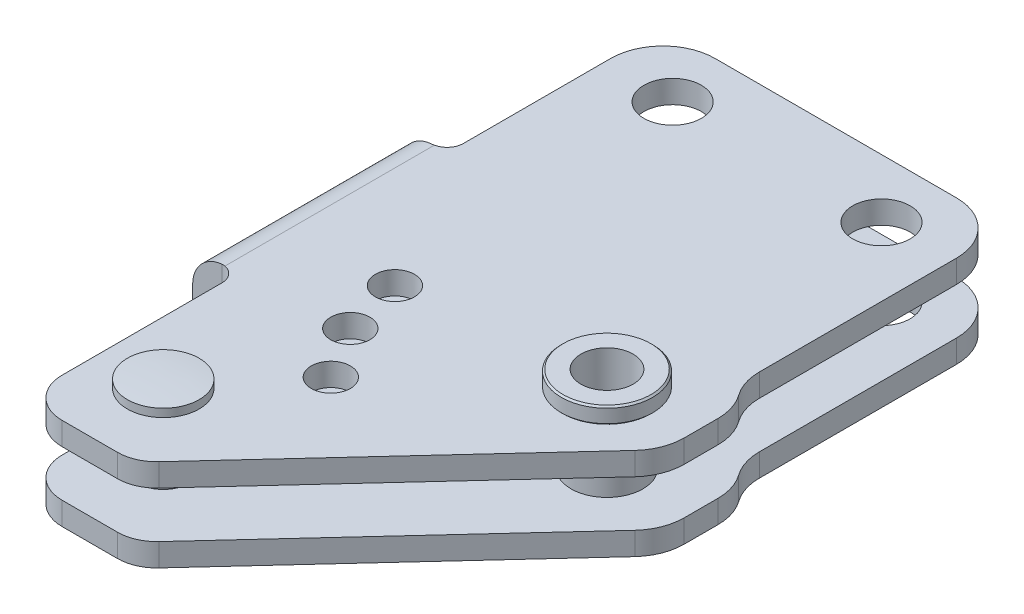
ISO-10303-21;
HEADER;
FILE_DESCRIPTION(('STEP AP214'),'2;1');
FILE_NAME('part.step','',(''),(''),'','','');
FILE_SCHEMA(('AUTOMOTIVE_DESIGN { 1 0 10303 214 1 1 1 1 }'));
ENDSEC;
DATA;
#1=APPLICATION_CONTEXT('core data for automotive mechanical design processes');
#2=APPLICATION_PROTOCOL_DEFINITION('international standard','automotive_design',2000,#1);
#3=PRODUCT_CONTEXT('',#1,'mechanical');
#4=PRODUCT('Part','Part','',(#3));
#5=PRODUCT_RELATED_PRODUCT_CATEGORY('part','',(#4));
#6=PRODUCT_DEFINITION_FORMATION('','',#4);
#7=PRODUCT_DEFINITION_CONTEXT('part definition',#1,'design');
#8=PRODUCT_DEFINITION('design','',#6,#7);
#9=PRODUCT_DEFINITION_SHAPE('','',#8);
#10=(LENGTH_UNIT() NAMED_UNIT(*) SI_UNIT(.MILLI.,.METRE.));
#11=(NAMED_UNIT(*) PLANE_ANGLE_UNIT() SI_UNIT($,.RADIAN.));
#12=(NAMED_UNIT(*) SI_UNIT($,.STERADIAN.) SOLID_ANGLE_UNIT());
#13=UNCERTAINTY_MEASURE_WITH_UNIT(LENGTH_MEASURE(1.E-05),#10,'distance_accuracy_value','');
#14=(GEOMETRIC_REPRESENTATION_CONTEXT(3) GLOBAL_UNCERTAINTY_ASSIGNED_CONTEXT((#13)) GLOBAL_UNIT_ASSIGNED_CONTEXT((#10,
#11,#12)) REPRESENTATION_CONTEXT('',''));
#15=CARTESIAN_POINT('',(0.,0.,0.));
#16=DIRECTION('',(0.,0.,1.));
#17=DIRECTION('',(1.,0.,0.));
#18=AXIS2_PLACEMENT_3D('',#15,#16,#17);
#19=CARTESIAN_POINT('',(33.,-9.65,43.06));
#20=DIRECTION('',(0.,1.,0.));
#21=DIRECTION('',(1.,0.,0.));
#22=AXIS2_PLACEMENT_3D('',#19,#20,#21);
#23=CYLINDRICAL_SURFACE('',#22,4.);
#24=CARTESIAN_POINT('',(33.,-9.6,43.06));
#25=DIRECTION('',(0.,-1.,0.));
#26=DIRECTION('',(1.,0.,0.));
#27=AXIS2_PLACEMENT_3D('',#24,#25,#26);
#28=CIRCLE('',#27,4.);
#29=CARTESIAN_POINT('',(37.,-9.6,43.06));
#30=VERTEX_POINT('',#29);
#31=EDGE_CURVE('E1720',#30,#30,#28,.F.);
#32=ORIENTED_EDGE('',*,*,#31,.F.);
#33=EDGE_LOOP('',(#32));
#34=FACE_BOUND('',#33,.T.);
#35=CARTESIAN_POINT('',(33.,9.6,43.06));
#36=DIRECTION('',(0.,1.,0.));
#37=DIRECTION('',(-1.,0.,0.));
#38=AXIS2_PLACEMENT_3D('',#35,#36,#37);
#39=CIRCLE('',#38,4.);
#40=CARTESIAN_POINT('',(29.,9.6,43.06));
#41=VERTEX_POINT('',#40);
#42=EDGE_CURVE('E1721',#41,#41,#39,.T.);
#43=ORIENTED_EDGE('',*,*,#42,.T.);
#44=EDGE_LOOP('',(#43));
#45=FACE_BOUND('',#44,.T.);
#46=ADVANCED_FACE('F14',(#34,#45),#23,.F.);
#47=CARTESIAN_POINT('',(33.,-7.05,43.06));
#48=DIRECTION('',(0.,-1.,0.));
#49=DIRECTION('',(-1.,0.,0.));
#50=AXIS2_PLACEMENT_3D('',#47,#48,#49);
#51=CYLINDRICAL_SURFACE('',#50,7.);
#52=CARTESIAN_POINT('',(33.,-9.35,43.06));
#53=DIRECTION('',(0.,-1.,0.));
#54=DIRECTION('',(1.,0.,0.));
#55=AXIS2_PLACEMENT_3D('',#52,#53,#54);
#56=CIRCLE('',#55,7.);
#57=CARTESIAN_POINT('',(40.,-9.35,43.06));
#58=VERTEX_POINT('',#57);
#59=EDGE_CURVE('E637',#58,#58,#56,.F.);
#60=ORIENTED_EDGE('',*,*,#59,.T.);
#61=EDGE_LOOP('',(#60));
#62=FACE_BOUND('',#61,.T.);
#63=CARTESIAN_POINT('',(33.,-7.25,43.06));
#64=DIRECTION('',(0.,-1.,0.));
#65=DIRECTION('',(-1.,0.,0.));
#66=AXIS2_PLACEMENT_3D('',#63,#64,#65);
#67=CIRCLE('',#66,7.);
#68=CARTESIAN_POINT('',(26.,-7.25,43.06));
#69=VERTEX_POINT('',#68);
#70=EDGE_CURVE('E1726',#69,#69,#67,.T.);
#71=ORIENTED_EDGE('',*,*,#70,.T.);
#72=EDGE_LOOP('',(#71));
#73=FACE_BOUND('',#72,.T.);
#74=ADVANCED_FACE('F658',(#62,#73),#51,.T.);
#75=CARTESIAN_POINT('',(33.,-7.05,43.06));
#76=DIRECTION('',(0.,-1.,0.));
#77=DIRECTION('',(-1.,0.,0.));
#78=AXIS2_PLACEMENT_3D('',#75,#76,#77);
#79=CONICAL_SURFACE('',#78,6.8,0.785398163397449);
#80=ORIENTED_EDGE('',*,*,#70,.F.);
#81=EDGE_LOOP('',(#80));
#82=FACE_BOUND('',#81,.T.);
#83=CARTESIAN_POINT('',(33.,-7.05,43.06));
#84=DIRECTION('',(0.,-1.,0.));
#85=DIRECTION('',(-1.,0.,0.));
#86=AXIS2_PLACEMENT_3D('',#83,#84,#85);
#87=CIRCLE('',#86,6.8);
#88=CARTESIAN_POINT('',(26.2,-7.05,43.06));
#89=VERTEX_POINT('',#88);
#90=EDGE_CURVE('E638',#89,#89,#87,.T.);
#91=ORIENTED_EDGE('',*,*,#90,.T.);
#92=EDGE_LOOP('',(#91));
#93=FACE_BOUND('',#92,.T.);
#94=ADVANCED_FACE('F665',(#82,#93),#79,.T.);
#95=CARTESIAN_POINT('',(33.,-9.65,43.06));
#96=DIRECTION('',(0.,1.,0.));
#97=DIRECTION('',(1.,0.,0.));
#98=AXIS2_PLACEMENT_3D('',#95,#96,#97);
#99=CYLINDRICAL_SURFACE('',#98,7.);
#100=CARTESIAN_POINT('',(33.,9.35,43.06));
#101=DIRECTION('',(0.,1.,0.));
#102=DIRECTION('',(-1.,0.,0.));
#103=AXIS2_PLACEMENT_3D('',#100,#101,#102);
#104=CIRCLE('',#103,7.);
#105=CARTESIAN_POINT('',(26.,9.35,43.06));
#106=VERTEX_POINT('',#105);
#107=EDGE_CURVE('E9',#106,#106,#104,.F.);
#108=ORIENTED_EDGE('',*,*,#107,.T.);
#109=EDGE_LOOP('',(#108));
#110=FACE_BOUND('',#109,.T.);
#111=CARTESIAN_POINT('',(33.,7.3,43.06));
#112=DIRECTION('',(0.,1.,0.));
#113=DIRECTION('',(1.,0.,0.));
#114=AXIS2_PLACEMENT_3D('',#111,#112,#113);
#115=CIRCLE('',#114,7.);
#116=CARTESIAN_POINT('',(40.,7.3,43.06));
#117=VERTEX_POINT('',#116);
#118=EDGE_CURVE('E590',#117,#117,#115,.T.);
#119=ORIENTED_EDGE('',*,*,#118,.T.);
#120=EDGE_LOOP('',(#119));
#121=FACE_BOUND('',#120,.T.);
#122=ADVANCED_FACE('F706',(#110,#121),#99,.T.);
#123=CARTESIAN_POINT('',(-1.,-51.4499999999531,77.0600000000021));
#124=DIRECTION('',(0.,1.,0.));
#125=DIRECTION('',(0.,0.,-1.));
#126=AXIS2_PLACEMENT_3D('',#123,#124,#125);
#127=SPHERICAL_SURFACE('',#126,59.9999999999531);
#128=CARTESIAN_POINT('',(-1.,8.2973848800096,77.06));
#129=DIRECTION('',(0.,1.,0.));
#130=DIRECTION('',(0.,0.,-1.));
#131=AXIS2_PLACEMENT_3D('',#128,#129,#130);
#132=CIRCLE('',#131,5.5);
#133=CARTESIAN_POINT('',(-1.,8.2973848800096,71.56));
#134=VERTEX_POINT('',#133);
#135=EDGE_CURVE('E1750',#134,#134,#132,.T.);
#136=ORIENTED_EDGE('',*,*,#135,.T.);
#137=EDGE_LOOP('',(#136));
#138=FACE_BOUND('',#137,.T.);
#139=ADVANCED_FACE('F703',(#138),#127,.T.);
#140=CARTESIAN_POINT('',(33.,7.05,43.06));
#141=DIRECTION('',(0.,1.,0.));
#142=DIRECTION('',(1.,0.,0.));
#143=AXIS2_PLACEMENT_3D('',#140,#141,#142);
#144=CONICAL_SURFACE('',#143,6.75,0.785398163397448);
#145=ORIENTED_EDGE('',*,*,#118,.F.);
#146=EDGE_LOOP('',(#145));
#147=FACE_BOUND('',#146,.T.);
#148=CARTESIAN_POINT('',(33.,7.05,43.06));
#149=DIRECTION('',(0.,1.,0.));
#150=DIRECTION('',(1.,0.,0.));
#151=AXIS2_PLACEMENT_3D('',#148,#149,#150);
#152=CIRCLE('',#151,6.75);
#153=CARTESIAN_POINT('',(39.75,7.05,43.06));
#154=VERTEX_POINT('',#153);
#155=EDGE_CURVE('E1734',#154,#154,#152,.T.);
#156=ORIENTED_EDGE('',*,*,#155,.T.);
#157=EDGE_LOOP('',(#156));
#158=FACE_BOUND('',#157,.T.);
#159=ADVANCED_FACE('F701',(#147,#158),#144,.T.);
#160=CARTESIAN_POINT('',(-1.,-4.3622867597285,77.06));
#161=DIRECTION('',(0.,1.,0.));
#162=DIRECTION('',(0.,0.,-1.));
#163=AXIS2_PLACEMENT_3D('',#160,#161,#162);
#164=CYLINDRICAL_SURFACE('',#163,5.5);
#165=CARTESIAN_POINT('',(-1.,7.05,77.06));
#166=DIRECTION('',(0.,1.,0.));
#167=DIRECTION('',(0.,0.,-1.));
#168=AXIS2_PLACEMENT_3D('',#165,#166,#167);
#169=CIRCLE('',#168,5.5);
#170=CARTESIAN_POINT('',(-1.,7.05,71.56));
#171=VERTEX_POINT('',#170);
#172=EDGE_CURVE('E1747',#171,#171,#169,.T.);
#173=ORIENTED_EDGE('',*,*,#172,.T.);
#174=EDGE_LOOP('',(#173));
#175=FACE_BOUND('',#174,.T.);
#176=ORIENTED_EDGE('',*,*,#135,.F.);
#177=EDGE_LOOP('',(#176));
#178=FACE_BOUND('',#177,.T.);
#179=ADVANCED_FACE('F697',(#175,#178),#164,.T.);
#180=CARTESIAN_POINT('',(0.,7.05,0.));
#181=DIRECTION('',(0.,-1.,0.));
#182=DIRECTION('',(1.,0.,0.));
#183=AXIS2_PLACEMENT_3D('',#180,#181,#182);
#184=CYLINDRICAL_SURFACE('',#183,4.4);
#185=CARTESIAN_POINT('',(0.,3.55,0.));
#186=DIRECTION('',(0.,-1.,0.));
#187=DIRECTION('',(1.,0.,0.));
#188=AXIS2_PLACEMENT_3D('',#185,#186,#187);
#189=CIRCLE('',#188,4.4);
#190=CARTESIAN_POINT('',(4.4,3.55,0.));
#191=VERTEX_POINT('',#190);
#192=EDGE_CURVE('E630',#191,#191,#189,.F.);
#193=ORIENTED_EDGE('',*,*,#192,.F.);
#194=EDGE_LOOP('',(#193));
#195=FACE_BOUND('',#194,.T.);
#196=CARTESIAN_POINT('',(0.,7.05,0.));
#197=DIRECTION('',(0.,1.,0.));
#198=DIRECTION('',(-1.,0.,0.));
#199=AXIS2_PLACEMENT_3D('',#196,#197,#198);
#200=CIRCLE('',#199,4.4);
#201=CARTESIAN_POINT('',(-4.4,7.05,0.));
#202=VERTEX_POINT('',#201);
#203=EDGE_CURVE('E633',#202,#202,#200,.T.);
#204=ORIENTED_EDGE('',*,*,#203,.T.);
#205=EDGE_LOOP('',(#204));
#206=FACE_BOUND('',#205,.T.);
#207=ADVANCED_FACE('F700',(#195,#206),#184,.F.);
#208=CARTESIAN_POINT('',(10.358712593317,7.05,62.741770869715));
#209=DIRECTION('',(0.,-1.,0.));
#210=DIRECTION('',(1.,0.,0.));
#211=AXIS2_PLACEMENT_3D('',#208,#209,#210);
#212=CYLINDRICAL_SURFACE('',#211,3.);
#213=CARTESIAN_POINT('',(10.358712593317,3.55,62.741770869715));
#214=DIRECTION('',(0.,-1.,0.));
#215=DIRECTION('',(1.,0.,0.));
#216=AXIS2_PLACEMENT_3D('',#213,#214,#215);
#217=CIRCLE('',#216,3.);
#218=CARTESIAN_POINT('',(13.358712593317,3.55,62.741770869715));
#219=VERTEX_POINT('',#218);
#220=EDGE_CURVE('E614',#219,#219,#217,.F.);
#221=ORIENTED_EDGE('',*,*,#220,.F.);
#222=EDGE_LOOP('',(#221));
#223=FACE_BOUND('',#222,.T.);
#224=CARTESIAN_POINT('',(10.358712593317,7.05,62.741770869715));
#225=DIRECTION('',(0.,1.,0.));
#226=DIRECTION('',(-1.,0.,0.));
#227=AXIS2_PLACEMENT_3D('',#224,#225,#226);
#228=CIRCLE('',#227,3.);
#229=CARTESIAN_POINT('',(7.358712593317,7.05,62.741770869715));
#230=VERTEX_POINT('',#229);
#231=EDGE_CURVE('E617',#230,#230,#228,.T.);
#232=ORIENTED_EDGE('',*,*,#231,.T.);
#233=EDGE_LOOP('',(#232));
#234=FACE_BOUND('',#233,.T.);
#235=ADVANCED_FACE('F710',(#223,#234),#212,.F.);
#236=CARTESIAN_POINT('',(3.114159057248,7.05,45.67467228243));
#237=DIRECTION('',(0.,-1.,0.));
#238=DIRECTION('',(1.,0.,0.));
#239=AXIS2_PLACEMENT_3D('',#236,#237,#238);
#240=CYLINDRICAL_SURFACE('',#239,3.);
#241=CARTESIAN_POINT('',(3.114159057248,3.55,45.67467228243));
#242=DIRECTION('',(0.,-1.,0.));
#243=DIRECTION('',(1.,0.,0.));
#244=AXIS2_PLACEMENT_3D('',#241,#242,#243);
#245=CIRCLE('',#244,3.);
#246=CARTESIAN_POINT('',(6.114159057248,3.55,45.67467228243));
#247=VERTEX_POINT('',#246);
#248=EDGE_CURVE('E598',#247,#247,#245,.F.);
#249=ORIENTED_EDGE('',*,*,#248,.F.);
#250=EDGE_LOOP('',(#249));
#251=FACE_BOUND('',#250,.T.);
#252=CARTESIAN_POINT('',(3.114159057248,7.05,45.67467228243));
#253=DIRECTION('',(0.,1.,0.));
#254=DIRECTION('',(-1.,0.,0.));
#255=AXIS2_PLACEMENT_3D('',#252,#253,#254);
#256=CIRCLE('',#255,3.);
#257=CARTESIAN_POINT('',(0.114159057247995,7.05,45.67467228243));
#258=VERTEX_POINT('',#257);
#259=EDGE_CURVE('E601',#258,#258,#256,.T.);
#260=ORIENTED_EDGE('',*,*,#259,.T.);
#261=EDGE_LOOP('',(#260));
#262=FACE_BOUND('',#261,.T.);
#263=ADVANCED_FACE('F726',(#251,#262),#240,.F.);
#264=CARTESIAN_POINT('',(-2.49999999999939,-7.05,-0.99999999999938));
#265=DIRECTION('',(0.,1.,0.));
#266=DIRECTION('',(-1.,0.,0.));
#267=AXIS2_PLACEMENT_3D('',#264,#265,#266);
#268=CYLINDRICAL_SURFACE('',#267,8.00000000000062);
#269=DIRECTION('',(0.,1.,0.));
#270=VECTOR('',#269,1.);
#271=CARTESIAN_POINT('',(-2.5,-7.05,-9.));
#272=LINE('',#271,#270);
#273=CARTESIAN_POINT('',(-2.49999999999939,3.55,-9.));
#274=VERTEX_POINT('',#273);
#275=CARTESIAN_POINT('',(-2.5,7.05,-9.));
#276=VERTEX_POINT('',#275);
#277=EDGE_CURVE('E427',#274,#276,#272,.T.);
#278=ORIENTED_EDGE('',*,*,#277,.F.);
#279=CARTESIAN_POINT('',(-2.49999999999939,3.55,-0.99999999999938));
#280=DIRECTION('',(0.,-1.,0.));
#281=DIRECTION('',(1.,0.,0.));
#282=AXIS2_PLACEMENT_3D('',#279,#280,#281);
#283=CIRCLE('',#282,8.00000000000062);
#284=CARTESIAN_POINT('',(-10.5,3.55,-0.99999999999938));
#285=VERTEX_POINT('',#284);
#286=EDGE_CURVE('E904',#274,#285,#283,.F.);
#287=ORIENTED_EDGE('',*,*,#286,.T.);
#288=DIRECTION('',(0.,1.,0.));
#289=VECTOR('',#288,1.);
#290=CARTESIAN_POINT('',(-10.5,-7.05,-0.99999999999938));
#291=LINE('',#290,#289);
#292=CARTESIAN_POINT('',(-10.5,7.05,-0.99999999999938));
#293=VERTEX_POINT('',#292);
#294=EDGE_CURVE('E423',#285,#293,#291,.T.);
#295=ORIENTED_EDGE('',*,*,#294,.T.);
#296=CARTESIAN_POINT('',(-2.49999999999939,7.05,-0.99999999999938));
#297=DIRECTION('',(0.,1.,0.));
#298=DIRECTION('',(1.,0.,0.));
#299=AXIS2_PLACEMENT_3D('',#296,#297,#298);
#300=CIRCLE('',#299,8.00000000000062);
#301=EDGE_CURVE('E1020',#276,#293,#300,.T.);
#302=ORIENTED_EDGE('',*,*,#301,.F.);
#303=EDGE_LOOP('',(#278,#287,#295,#302));
#304=FACE_BOUND('',#303,.T.);
#305=ADVANCED_FACE('F739',(#304),#268,.T.);
#306=CARTESIAN_POINT('',(-4.499999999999,-7.05,83.059999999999));
#307=DIRECTION('',(0.,1.,0.));
#308=DIRECTION('',(-1.,0.,0.));
#309=AXIS2_PLACEMENT_3D('',#306,#307,#308);
#310=CYLINDRICAL_SURFACE('',#309,6.00000000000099);
#311=DIRECTION('',(0.,1.,0.));
#312=VECTOR('',#311,1.);
#313=CARTESIAN_POINT('',(-10.5,-7.05,83.06));
#314=LINE('',#313,#312);
#315=CARTESIAN_POINT('',(-10.5,3.55,83.06));
#316=VERTEX_POINT('',#315);
#317=CARTESIAN_POINT('',(-10.5,7.05,83.06));
#318=VERTEX_POINT('',#317);
#319=EDGE_CURVE('E400',#316,#318,#314,.T.);
#320=ORIENTED_EDGE('',*,*,#319,.F.);
#321=CARTESIAN_POINT('',(-4.499999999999,3.55,83.059999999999));
#322=DIRECTION('',(0.,-1.,0.));
#323=DIRECTION('',(1.,0.,0.));
#324=AXIS2_PLACEMENT_3D('',#321,#322,#323);
#325=CIRCLE('',#324,6.00000000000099);
#326=CARTESIAN_POINT('',(-4.5,3.55,89.06));
#327=VERTEX_POINT('',#326);
#328=EDGE_CURVE('E893',#316,#327,#325,.F.);
#329=ORIENTED_EDGE('',*,*,#328,.T.);
#330=DIRECTION('',(0.,1.,0.));
#331=VECTOR('',#330,1.);
#332=CARTESIAN_POINT('',(-4.5,-7.05,89.06));
#333=LINE('',#332,#331);
#334=CARTESIAN_POINT('',(-4.5,7.05,89.06));
#335=VERTEX_POINT('',#334);
#336=EDGE_CURVE('E396',#327,#335,#333,.T.);
#337=ORIENTED_EDGE('',*,*,#336,.T.);
#338=CARTESIAN_POINT('',(-4.499999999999,7.05,83.059999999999));
#339=DIRECTION('',(0.,1.,0.));
#340=DIRECTION('',(-1.,0.,0.));
#341=AXIS2_PLACEMENT_3D('',#338,#339,#340);
#342=CIRCLE('',#341,6.00000000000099);
#343=EDGE_CURVE('E311',#318,#335,#342,.T.);
#344=ORIENTED_EDGE('',*,*,#343,.F.);
#345=EDGE_LOOP('',(#320,#329,#337,#344));
#346=FACE_BOUND('',#345,.T.);
#347=ADVANCED_FACE('F745',(#346),#310,.T.);
#348=CARTESIAN_POINT('',(-4.5,-7.05,89.06));
#349=DIRECTION('',(0.,0.,1.));
#350=DIRECTION('',(0.,1.,0.));
#351=AXIS2_PLACEMENT_3D('',#348,#349,#350);
#352=PLANE('',#351);
#353=ORIENTED_EDGE('',*,*,#336,.F.);
#354=DIRECTION('',(-1.,0.,0.));
#355=VECTOR('',#354,1.);
#356=CARTESIAN_POINT('',(49.,3.55,89.06));
#357=LINE('',#356,#355);
#358=CARTESIAN_POINT('',(3.99999999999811,3.55,89.06));
#359=VERTEX_POINT('',#358);
#360=EDGE_CURVE('E859',#359,#327,#357,.T.);
#361=ORIENTED_EDGE('',*,*,#360,.F.);
#362=DIRECTION('',(0.,1.,0.));
#363=VECTOR('',#362,1.);
#364=CARTESIAN_POINT('',(4.,-7.05,89.06));
#365=LINE('',#364,#363);
#366=CARTESIAN_POINT('',(4.,7.05,89.06));
#367=VERTEX_POINT('',#366);
#368=EDGE_CURVE('E392',#359,#367,#365,.T.);
#369=ORIENTED_EDGE('',*,*,#368,.T.);
#370=DIRECTION('',(1.,0.,0.));
#371=VECTOR('',#370,1.);
#372=CARTESIAN_POINT('',(-4.5,7.05,89.06));
#373=LINE('',#372,#371);
#374=EDGE_CURVE('E318',#335,#367,#373,.T.);
#375=ORIENTED_EDGE('',*,*,#374,.F.);
#376=EDGE_LOOP('',(#353,#361,#369,#375));
#377=FACE_BOUND('',#376,.T.);
#378=ADVANCED_FACE('F961',(#377),#352,.T.);
#379=CARTESIAN_POINT('',(3.99999999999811,-7.05,83.0599999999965));
#380=DIRECTION('',(0.,1.,0.));
#381=DIRECTION('',(-1.,0.,0.));
#382=AXIS2_PLACEMENT_3D('',#379,#380,#381);
#383=CYLINDRICAL_SURFACE('',#382,6.00000000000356);
#384=ORIENTED_EDGE('',*,*,#368,.F.);
#385=CARTESIAN_POINT('',(3.99999999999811,3.55,83.0599999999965));
#386=DIRECTION('',(0.,-1.,0.));
#387=DIRECTION('',(1.,0.,0.));
#388=AXIS2_PLACEMENT_3D('',#385,#386,#387);
#389=CIRCLE('',#388,6.00000000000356);
#390=CARTESIAN_POINT('',(8.413613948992,3.55,87.124481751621));
#391=VERTEX_POINT('',#390);
#392=EDGE_CURVE('E875',#359,#391,#389,.F.);
#393=ORIENTED_EDGE('',*,*,#392,.T.);
#394=DIRECTION('',(0.,1.,0.));
#395=VECTOR('',#394,1.);
#396=CARTESIAN_POINT('',(8.413613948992,-7.05,87.124481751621));
#397=LINE('',#396,#395);
#398=CARTESIAN_POINT('',(8.413613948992,7.05,87.124481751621));
#399=VERTEX_POINT('',#398);
#400=EDGE_CURVE('E388',#391,#399,#397,.T.);
#401=ORIENTED_EDGE('',*,*,#400,.T.);
#402=CARTESIAN_POINT('',(3.99999999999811,7.05,83.0599999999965));
#403=DIRECTION('',(0.,1.,0.));
#404=DIRECTION('',(-1.,0.,0.));
#405=AXIS2_PLACEMENT_3D('',#402,#403,#404);
#406=CIRCLE('',#405,6.00000000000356);
#407=EDGE_CURVE('E321',#367,#399,#406,.T.);
#408=ORIENTED_EDGE('',*,*,#407,.F.);
#409=EDGE_LOOP('',(#384,#393,#401,#408));
#410=FACE_BOUND('',#409,.T.);
#411=ADVANCED_FACE('F958',(#410),#383,.T.);
#412=CARTESIAN_POINT('',(8.413613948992,-7.05,87.124481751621));
#413=DIRECTION('',(0.735602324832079,0.,0.677413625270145));
#414=DIRECTION('',(0.677413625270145,0.,-0.735602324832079));
#415=AXIS2_PLACEMENT_3D('',#412,#413,#414);
#416=PLANE('',#415);
#417=ORIENTED_EDGE('',*,*,#400,.F.);
#418=DIRECTION('',(0.677413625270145,0.,-0.735602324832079));
#419=VECTOR('',#418,1.);
#420=CARTESIAN_POINT('',(8.413613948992,3.55,87.124481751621));
#421=LINE('',#420,#419);
#422=CARTESIAN_POINT('',(43.3848185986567,3.55,49.149309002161));
#423=VERTEX_POINT('',#422);
#424=EDGE_CURVE('E872',#391,#423,#421,.T.);
#425=ORIENTED_EDGE('',*,*,#424,.T.);
#426=DIRECTION('',(0.,1.,0.));
#427=VECTOR('',#426,1.);
#428=CARTESIAN_POINT('',(43.3848185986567,-7.05,49.149309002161));
#429=LINE('',#428,#427);
#430=CARTESIAN_POINT('',(43.3848185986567,7.05,49.149309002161));
#431=VERTEX_POINT('',#430);
#432=EDGE_CURVE('E384',#423,#431,#429,.T.);
#433=ORIENTED_EDGE('',*,*,#432,.T.);
#434=DIRECTION('',(0.677413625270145,0.,-0.735602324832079));
#435=VECTOR('',#434,1.);
#436=CARTESIAN_POINT('',(8.413613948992,7.05,87.124481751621));
#437=LINE('',#436,#435);
#438=EDGE_CURVE('E324',#399,#431,#437,.T.);
#439=ORIENTED_EDGE('',*,*,#438,.F.);
#440=EDGE_LOOP('',(#417,#425,#433,#439));
#441=FACE_BOUND('',#440,.T.);
#442=ADVANCED_FACE('F955',(#441),#416,.T.);
#443=CARTESIAN_POINT('',(37.4999999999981,-7.05,43.7299999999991));
#444=DIRECTION('',(0.,1.,0.));
#445=DIRECTION('',(-1.,0.,0.));
#446=AXIS2_PLACEMENT_3D('',#443,#444,#445);
#447=CYLINDRICAL_SURFACE('',#446,8.0000000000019);
#448=ORIENTED_EDGE('',*,*,#432,.F.);
#449=CARTESIAN_POINT('',(37.4999999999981,3.55,43.7299999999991));
#450=DIRECTION('',(0.,-1.,0.));
#451=DIRECTION('',(1.,0.,0.));
#452=AXIS2_PLACEMENT_3D('',#449,#450,#451);
#453=CIRCLE('',#452,8.0000000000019);
#454=CARTESIAN_POINT('',(45.5,3.55,43.73));
#455=VERTEX_POINT('',#454);
#456=EDGE_CURVE('E451',#423,#455,#453,.F.);
#457=ORIENTED_EDGE('',*,*,#456,.T.);
#458=DIRECTION('',(0.,1.,0.));
#459=VECTOR('',#458,1.);
#460=CARTESIAN_POINT('',(45.5,-7.05,43.73));
#461=LINE('',#460,#459);
#462=CARTESIAN_POINT('',(45.5,7.05,43.73));
#463=VERTEX_POINT('',#462);
#464=EDGE_CURVE('E378',#455,#463,#461,.T.);
#465=ORIENTED_EDGE('',*,*,#464,.T.);
#466=CARTESIAN_POINT('',(37.4999999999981,7.05,43.7299999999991));
#467=DIRECTION('',(0.,1.,0.));
#468=DIRECTION('',(-1.,0.,0.));
#469=AXIS2_PLACEMENT_3D('',#466,#467,#468);
#470=CIRCLE('',#469,8.0000000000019);
#471=EDGE_CURVE('E327',#431,#463,#470,.T.);
#472=ORIENTED_EDGE('',*,*,#471,.F.);
#473=EDGE_LOOP('',(#448,#457,#465,#472));
#474=FACE_BOUND('',#473,.T.);
#475=ADVANCED_FACE('F952',(#474),#447,.T.);
#476=CARTESIAN_POINT('',(45.5,-7.05,43.73));
#477=DIRECTION('',(1.,0.,0.));
#478=DIRECTION('',(0.,1.,0.));
#479=AXIS2_PLACEMENT_3D('',#476,#477,#478);
#480=PLANE('',#479);
#481=ORIENTED_EDGE('',*,*,#464,.F.);
#482=DIRECTION('',(0.,0.,-1.));
#483=VECTOR('',#482,1.);
#484=CARTESIAN_POINT('',(45.5,3.55,43.73));
#485=LINE('',#484,#483);
#486=CARTESIAN_POINT('',(45.5,3.55,38.54));
#487=VERTEX_POINT('',#486);
#488=EDGE_CURVE('E878',#455,#487,#485,.T.);
#489=ORIENTED_EDGE('',*,*,#488,.T.);
#490=DIRECTION('',(0.,1.,0.));
#491=VECTOR('',#490,1.);
#492=CARTESIAN_POINT('',(45.5,-7.05,38.54));
#493=LINE('',#492,#491);
#494=CARTESIAN_POINT('',(45.5,7.05,38.54));
#495=VERTEX_POINT('',#494);
#496=EDGE_CURVE('E447',#487,#495,#493,.T.);
#497=ORIENTED_EDGE('',*,*,#496,.T.);
#498=DIRECTION('',(0.,0.,-1.));
#499=VECTOR('',#498,1.);
#500=CARTESIAN_POINT('',(45.5,7.05,43.73));
#501=LINE('',#500,#499);
#502=EDGE_CURVE('E331',#463,#495,#501,.T.);
#503=ORIENTED_EDGE('',*,*,#502,.F.);
#504=EDGE_LOOP('',(#481,#489,#497,#503));
#505=FACE_BOUND('',#504,.T.);
#506=ADVANCED_FACE('F995',(#505),#480,.T.);
#507=CARTESIAN_POINT('',(37.5000000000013,-7.05,38.54));
#508=DIRECTION('',(0.,1.,0.));
#509=DIRECTION('',(-1.,0.,0.));
#510=AXIS2_PLACEMENT_3D('',#507,#508,#509);
#511=CYLINDRICAL_SURFACE('',#510,7.99999999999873);
#512=ORIENTED_EDGE('',*,*,#496,.F.);
#513=CARTESIAN_POINT('',(37.5000000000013,3.55,38.54));
#514=DIRECTION('',(0.,-1.,0.));
#515=DIRECTION('',(1.,0.,0.));
#516=AXIS2_PLACEMENT_3D('',#513,#514,#515);
#517=CIRCLE('',#516,7.99999999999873);
#518=CARTESIAN_POINT('',(44.,3.55,33.876310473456));
#519=VERTEX_POINT('',#518);
#520=EDGE_CURVE('E881',#487,#519,#517,.F.);
#521=ORIENTED_EDGE('',*,*,#520,.T.);
#522=DIRECTION('',(0.,1.,0.));
#523=VECTOR('',#522,1.);
#524=CARTESIAN_POINT('',(44.,-7.05,33.876310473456));
#525=LINE('',#524,#523);
#526=CARTESIAN_POINT('',(44.,7.05,33.876310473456));
#527=VERTEX_POINT('',#526);
#528=EDGE_CURVE('E443',#519,#527,#525,.T.);
#529=ORIENTED_EDGE('',*,*,#528,.T.);
#530=CARTESIAN_POINT('',(37.5000000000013,7.05,38.54));
#531=DIRECTION('',(0.,1.,0.));
#532=DIRECTION('',(-1.,0.,0.));
#533=AXIS2_PLACEMENT_3D('',#530,#531,#532);
#534=CIRCLE('',#533,7.99999999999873);
#535=EDGE_CURVE('E334',#495,#527,#534,.T.);
#536=ORIENTED_EDGE('',*,*,#535,.F.);
#537=EDGE_LOOP('',(#512,#521,#529,#536));
#538=FACE_BOUND('',#537,.T.);
#539=ADVANCED_FACE('F1045',(#538),#511,.T.);
#540=CARTESIAN_POINT('',(50.5000000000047,-7.05,29.2126209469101));
#541=DIRECTION('',(0.,1.,0.));
#542=DIRECTION('',(-1.,0.,0.));
#543=AXIS2_PLACEMENT_3D('',#540,#541,#542);
#544=CYLINDRICAL_SURFACE('',#543,8.00000000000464);
#545=ORIENTED_EDGE('',*,*,#528,.F.);
#546=CARTESIAN_POINT('',(50.5000000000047,3.55,29.2126209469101));
#547=DIRECTION('',(0.,-1.,0.));
#548=DIRECTION('',(1.,0.,0.));
#549=AXIS2_PLACEMENT_3D('',#546,#547,#548);
#550=CIRCLE('',#549,8.00000000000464);
#551=CARTESIAN_POINT('',(42.5,3.55,29.2126209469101));
#552=VERTEX_POINT('',#551);
#553=EDGE_CURVE('E884',#519,#552,#550,.T.);
#554=ORIENTED_EDGE('',*,*,#553,.T.);
#555=DIRECTION('',(0.,1.,0.));
#556=VECTOR('',#555,1.);
#557=CARTESIAN_POINT('',(42.5,-7.05,29.2126209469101));
#558=LINE('',#557,#556);
#559=CARTESIAN_POINT('',(42.5,7.05,29.2126209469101));
#560=VERTEX_POINT('',#559);
#561=EDGE_CURVE('E439',#552,#560,#558,.T.);
#562=ORIENTED_EDGE('',*,*,#561,.T.);
#563=CARTESIAN_POINT('',(50.5000000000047,7.05,29.2126209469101));
#564=DIRECTION('',(0.,-1.,0.));
#565=DIRECTION('',(1.,0.,0.));
#566=AXIS2_PLACEMENT_3D('',#563,#564,#565);
#567=CIRCLE('',#566,8.00000000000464);
#568=EDGE_CURVE('E1002',#527,#560,#567,.T.);
#569=ORIENTED_EDGE('',*,*,#568,.F.);
#570=EDGE_LOOP('',(#545,#554,#562,#569));
#571=FACE_BOUND('',#570,.T.);
#572=ADVANCED_FACE('F1008',(#571),#544,.F.);
#573=CARTESIAN_POINT('',(42.5,-7.05,29.212620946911));
#574=DIRECTION('',(1.,0.,0.));
#575=DIRECTION('',(0.,1.,0.));
#576=AXIS2_PLACEMENT_3D('',#573,#574,#575);
#577=PLANE('',#576);
#578=ORIENTED_EDGE('',*,*,#561,.F.);
#579=DIRECTION('',(0.,0.,-1.));
#580=VECTOR('',#579,1.);
#581=CARTESIAN_POINT('',(42.5,3.55,29.212620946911));
#582=LINE('',#581,#580);
#583=CARTESIAN_POINT('',(42.5,3.55,-1.));
#584=VERTEX_POINT('',#583);
#585=EDGE_CURVE('E887',#552,#584,#582,.T.);
#586=ORIENTED_EDGE('',*,*,#585,.T.);
#587=DIRECTION('',(0.,1.,0.));
#588=VECTOR('',#587,1.);
#589=CARTESIAN_POINT('',(42.5,-7.05,-1.));
#590=LINE('',#589,#588);
#591=CARTESIAN_POINT('',(42.5,7.05,-1.));
#592=VERTEX_POINT('',#591);
#593=EDGE_CURVE('E435',#584,#592,#590,.T.);
#594=ORIENTED_EDGE('',*,*,#593,.T.);
#595=DIRECTION('',(0.,0.,-1.));
#596=VECTOR('',#595,1.);
#597=CARTESIAN_POINT('',(42.5,7.05,29.212620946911));
#598=LINE('',#597,#596);
#599=EDGE_CURVE('E1010',#560,#592,#598,.T.);
#600=ORIENTED_EDGE('',*,*,#599,.F.);
#601=EDGE_LOOP('',(#578,#586,#594,#600));
#602=FACE_BOUND('',#601,.T.);
#603=ADVANCED_FACE('F1036',(#602),#577,.T.);
#604=CARTESIAN_POINT('',(34.5,-7.05,-1.));
#605=DIRECTION('',(0.,1.,0.));
#606=DIRECTION('',(-1.,0.,0.));
#607=AXIS2_PLACEMENT_3D('',#604,#605,#606);
#608=CYLINDRICAL_SURFACE('',#607,8.);
#609=ORIENTED_EDGE('',*,*,#593,.F.);
#610=CARTESIAN_POINT('',(34.5,3.55,-1.));
#611=DIRECTION('',(0.,-1.,0.));
#612=DIRECTION('',(1.,0.,0.));
#613=AXIS2_PLACEMENT_3D('',#610,#611,#612);
#614=CIRCLE('',#613,8.);
#615=CARTESIAN_POINT('',(34.5,3.55,-9.));
#616=VERTEX_POINT('',#615);
#617=EDGE_CURVE('E890',#584,#616,#614,.F.);
#618=ORIENTED_EDGE('',*,*,#617,.T.);
#619=DIRECTION('',(0.,1.,0.));
#620=VECTOR('',#619,1.);
#621=CARTESIAN_POINT('',(34.5,-7.05,-9.));
#622=LINE('',#621,#620);
#623=CARTESIAN_POINT('',(34.5,7.05,-9.));
#624=VERTEX_POINT('',#623);
#625=EDGE_CURVE('E431',#616,#624,#622,.T.);
#626=ORIENTED_EDGE('',*,*,#625,.T.);
#627=CARTESIAN_POINT('',(34.5,7.05,-1.));
#628=DIRECTION('',(0.,1.,0.));
#629=DIRECTION('',(-1.,0.,0.));
#630=AXIS2_PLACEMENT_3D('',#627,#628,#629);
#631=CIRCLE('',#630,8.);
#632=EDGE_CURVE('E1012',#592,#624,#631,.T.);
#633=ORIENTED_EDGE('',*,*,#632,.F.);
#634=EDGE_LOOP('',(#609,#618,#626,#633));
#635=FACE_BOUND('',#634,.T.);
#636=ADVANCED_FACE('F1034',(#635),#608,.T.);
#637=CARTESIAN_POINT('',(34.5,-7.05,-9.));
#638=DIRECTION('',(0.,0.,-1.));
#639=DIRECTION('',(0.,-1.,0.));
#640=AXIS2_PLACEMENT_3D('',#637,#638,#639);
#641=PLANE('',#640);
#642=ORIENTED_EDGE('',*,*,#625,.F.);
#643=DIRECTION('',(-1.,0.,0.));
#644=VECTOR('',#643,1.);
#645=CARTESIAN_POINT('',(49.,3.55,-9.));
#646=LINE('',#645,#644);
#647=EDGE_CURVE('E852',#616,#274,#646,.T.);
#648=ORIENTED_EDGE('',*,*,#647,.T.);
#649=ORIENTED_EDGE('',*,*,#277,.T.);
#650=DIRECTION('',(-1.,0.,0.));
#651=VECTOR('',#650,1.);
#652=CARTESIAN_POINT('',(34.5,7.05,-9.));
#653=LINE('',#652,#651);
#654=EDGE_CURVE('E1017',#624,#276,#653,.T.);
#655=ORIENTED_EDGE('',*,*,#654,.F.);
#656=EDGE_LOOP('',(#642,#648,#649,#655));
#657=FACE_BOUND('',#656,.T.);
#658=ADVANCED_FACE('F734',(#657),#641,.T.);
#659=CARTESIAN_POINT('',(5.384854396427,7.05,54.781933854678));
#660=DIRECTION('',(0.,-1.,0.));
#661=DIRECTION('',(1.,0.,0.));
#662=AXIS2_PLACEMENT_3D('',#659,#660,#661);
#663=CYLINDRICAL_SURFACE('',#662,3.);
#664=CARTESIAN_POINT('',(5.384854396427,3.55,54.781933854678));
#665=DIRECTION('',(0.,-1.,0.));
#666=DIRECTION('',(1.,0.,0.));
#667=AXIS2_PLACEMENT_3D('',#664,#665,#666);
#668=CIRCLE('',#667,3.);
#669=CARTESIAN_POINT('',(8.384854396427,3.55,54.781933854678));
#670=VERTEX_POINT('',#669);
#671=EDGE_CURVE('E606',#670,#670,#668,.F.);
#672=ORIENTED_EDGE('',*,*,#671,.F.);
#673=EDGE_LOOP('',(#672));
#674=FACE_BOUND('',#673,.T.);
#675=CARTESIAN_POINT('',(5.384854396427,7.05,54.781933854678));
#676=DIRECTION('',(0.,1.,0.));
#677=DIRECTION('',(-1.,0.,0.));
#678=AXIS2_PLACEMENT_3D('',#675,#676,#677);
#679=CIRCLE('',#678,3.);
#680=CARTESIAN_POINT('',(2.384854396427,7.05,54.781933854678));
#681=VERTEX_POINT('',#680);
#682=EDGE_CURVE('E609',#681,#681,#679,.T.);
#683=ORIENTED_EDGE('',*,*,#682,.T.);
#684=EDGE_LOOP('',(#683));
#685=FACE_BOUND('',#684,.T.);
#686=ADVANCED_FACE('F718',(#674,#685),#663,.F.);
#687=CARTESIAN_POINT('',(32.,7.05,0.));
#688=DIRECTION('',(0.,-1.,0.));
#689=DIRECTION('',(1.,0.,0.));
#690=AXIS2_PLACEMENT_3D('',#687,#688,#689);
#691=CYLINDRICAL_SURFACE('',#690,4.4);
#692=CARTESIAN_POINT('',(32.,3.55,0.));
#693=DIRECTION('',(0.,-1.,0.));
#694=DIRECTION('',(1.,0.,0.));
#695=AXIS2_PLACEMENT_3D('',#692,#693,#694);
#696=CIRCLE('',#695,4.4);
#697=CARTESIAN_POINT('',(36.4,3.55,0.));
#698=VERTEX_POINT('',#697);
#699=EDGE_CURVE('E622',#698,#698,#696,.F.);
#700=ORIENTED_EDGE('',*,*,#699,.F.);
#701=EDGE_LOOP('',(#700));
#702=FACE_BOUND('',#701,.T.);
#703=CARTESIAN_POINT('',(32.,7.05,0.));
#704=DIRECTION('',(0.,1.,0.));
#705=DIRECTION('',(-1.,0.,0.));
#706=AXIS2_PLACEMENT_3D('',#703,#704,#705);
#707=CIRCLE('',#706,4.4);
#708=CARTESIAN_POINT('',(27.6,7.05,0.));
#709=VERTEX_POINT('',#708);
#710=EDGE_CURVE('E625',#709,#709,#707,.T.);
#711=ORIENTED_EDGE('',*,*,#710,.T.);
#712=EDGE_LOOP('',(#711));
#713=FACE_BOUND('',#712,.T.);
#714=ADVANCED_FACE('F678',(#702,#713),#691,.F.);
#715=CARTESIAN_POINT('',(-1.,-5.95,77.06));
#716=DIRECTION('',(0.,-1.,0.));
#717=DIRECTION('',(0.,0.,1.));
#718=AXIS2_PLACEMENT_3D('',#715,#716,#717);
#719=CONICAL_SURFACE('',#718,2.75,1.04719755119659);
#720=CARTESIAN_POINT('',(-1.,-4.3622867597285,77.06));
#721=VERTEX_POINT('',#720);
#722=VERTEX_LOOP('',#721);
#723=FACE_BOUND('',#722,.T.);
#724=CARTESIAN_POINT('',(-1.,-5.95,77.06));
#725=DIRECTION('',(0.,1.,0.));
#726=DIRECTION('',(0.,0.,-1.));
#727=AXIS2_PLACEMENT_3D('',#724,#725,#726);
#728=CIRCLE('',#727,2.75);
#729=CARTESIAN_POINT('',(-1.,-5.95,74.31));
#730=VERTEX_POINT('',#729);
#731=EDGE_CURVE('E582',#730,#730,#728,.T.);
#732=ORIENTED_EDGE('',*,*,#731,.F.);
#733=EDGE_LOOP('',(#732));
#734=FACE_BOUND('',#733,.T.);
#735=ADVANCED_FACE('F674',(#723,#734),#719,.F.);
#736=CARTESIAN_POINT('',(-10.5,-7.05,-1.));
#737=DIRECTION('',(-1.,0.,0.));
#738=DIRECTION('',(0.,-1.,0.));
#739=AXIS2_PLACEMENT_3D('',#736,#737,#738);
#740=PLANE('',#739);
#741=ORIENTED_EDGE('',*,*,#294,.F.);
#742=DIRECTION('',(0.,0.,1.));
#743=VECTOR('',#742,1.);
#744=CARTESIAN_POINT('',(-10.5,3.55,-1.));
#745=LINE('',#744,#743);
#746=CARTESIAN_POINT('',(-10.5,3.55,21.5599999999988));
#747=VERTEX_POINT('',#746);
#748=EDGE_CURVE('E901',#285,#747,#745,.T.);
#749=ORIENTED_EDGE('',*,*,#748,.T.);
#750=DIRECTION('',(0.,1.,0.));
#751=VECTOR('',#750,1.);
#752=CARTESIAN_POINT('',(-10.5,-7.05,21.56));
#753=LINE('',#752,#751);
#754=CARTESIAN_POINT('',(-10.5,7.05,21.56));
#755=VERTEX_POINT('',#754);
#756=EDGE_CURVE('E419',#747,#755,#753,.T.);
#757=ORIENTED_EDGE('',*,*,#756,.T.);
#758=DIRECTION('',(0.,0.,1.));
#759=VECTOR('',#758,1.);
#760=CARTESIAN_POINT('',(-10.5,7.05,-1.));
#761=LINE('',#760,#759);
#762=EDGE_CURVE('E313',#293,#755,#761,.T.);
#763=ORIENTED_EDGE('',*,*,#762,.F.);
#764=EDGE_LOOP('',(#741,#749,#757,#763));
#765=FACE_BOUND('',#764,.T.);
#766=ADVANCED_FACE('F677',(#765),#740,.T.);
#767=CARTESIAN_POINT('',(-10.5,-7.05,58.56));
#768=DIRECTION('',(-1.,0.,0.));
#769=DIRECTION('',(0.,-1.,0.));
#770=AXIS2_PLACEMENT_3D('',#767,#768,#769);
#771=PLANE('',#770);
#772=DIRECTION('',(0.,1.,0.));
#773=VECTOR('',#772,1.);
#774=CARTESIAN_POINT('',(-10.5,-7.05,58.56));
#775=LINE('',#774,#773);
#776=CARTESIAN_POINT('',(-10.5,3.55,58.56));
#777=VERTEX_POINT('',#776);
#778=CARTESIAN_POINT('',(-10.5,7.05,58.56));
#779=VERTEX_POINT('',#778);
#780=EDGE_CURVE('E307',#777,#779,#775,.T.);
#781=ORIENTED_EDGE('',*,*,#780,.F.);
#782=DIRECTION('',(0.,0.,1.));
#783=VECTOR('',#782,1.);
#784=CARTESIAN_POINT('',(-10.5,3.55,58.56));
#785=LINE('',#784,#783);
#786=EDGE_CURVE('E896',#777,#316,#785,.T.);
#787=ORIENTED_EDGE('',*,*,#786,.T.);
#788=ORIENTED_EDGE('',*,*,#319,.T.);
#789=DIRECTION('',(0.,0.,1.));
#790=VECTOR('',#789,1.);
#791=CARTESIAN_POINT('',(-10.5,7.05,58.56));
#792=LINE('',#791,#790);
#793=EDGE_CURVE('E309',#779,#318,#792,.T.);
#794=ORIENTED_EDGE('',*,*,#793,.F.);
#795=EDGE_LOOP('',(#781,#787,#788,#794));
#796=FACE_BOUND('',#795,.T.);
#797=ADVANCED_FACE('F946',(#796),#771,.T.);
#798=CARTESIAN_POINT('',(37.5000000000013,7.05,38.54));
#799=DIRECTION('',(0.,1.,0.));
#800=DIRECTION('',(-1.,0.,0.));
#801=AXIS2_PLACEMENT_3D('',#798,#799,#800);
#802=PLANE('',#801);
#803=ORIENTED_EDGE('',*,*,#172,.F.);
#804=EDGE_LOOP('',(#803));
#805=FACE_BOUND('',#804,.T.);
#806=ORIENTED_EDGE('',*,*,#710,.F.);
#807=EDGE_LOOP('',(#806));
#808=FACE_BOUND('',#807,.T.);
#809=ORIENTED_EDGE('',*,*,#682,.F.);
#810=EDGE_LOOP('',(#809));
#811=FACE_BOUND('',#810,.T.);
#812=DIRECTION('',(0.,0.,-1.));
#813=VECTOR('',#812,1.);
#814=CARTESIAN_POINT('',(-12.5,7.05,89.06));
#815=LINE('',#814,#813);
#816=CARTESIAN_POINT('',(-12.5,7.05,56.110510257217));
#817=VERTEX_POINT('',#816);
#818=CARTESIAN_POINT('',(-12.5,7.05,24.0094897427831));
#819=VERTEX_POINT('',#818);
#820=EDGE_CURVE('E281',#817,#819,#815,.T.);
#821=ORIENTED_EDGE('',*,*,#820,.F.);
#822=CARTESIAN_POINT('',(-13.0000000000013,7.05,58.5600000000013));
#823=DIRECTION('',(0.,-1.,0.));
#824=DIRECTION('',(-1.,0.,0.));
#825=AXIS2_PLACEMENT_3D('',#822,#823,#824);
#826=CIRCLE('',#825,2.50000000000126);
#827=EDGE_CURVE('E296',#817,#779,#826,.T.);
#828=ORIENTED_EDGE('',*,*,#827,.T.);
#829=ORIENTED_EDGE('',*,*,#793,.T.);
#830=ORIENTED_EDGE('',*,*,#343,.T.);
#831=ORIENTED_EDGE('',*,*,#374,.T.);
#832=ORIENTED_EDGE('',*,*,#407,.T.);
#833=ORIENTED_EDGE('',*,*,#438,.T.);
#834=ORIENTED_EDGE('',*,*,#471,.T.);
#835=ORIENTED_EDGE('',*,*,#502,.T.);
#836=ORIENTED_EDGE('',*,*,#535,.T.);
#837=ORIENTED_EDGE('',*,*,#568,.T.);
#838=ORIENTED_EDGE('',*,*,#599,.T.);
#839=ORIENTED_EDGE('',*,*,#632,.T.);
#840=ORIENTED_EDGE('',*,*,#654,.T.);
#841=ORIENTED_EDGE('',*,*,#301,.T.);
#842=ORIENTED_EDGE('',*,*,#762,.T.);
#843=CARTESIAN_POINT('',(-13.0000000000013,7.05,21.5599999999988));
#844=DIRECTION('',(0.,-1.,0.));
#845=DIRECTION('',(-1.,0.,0.));
#846=AXIS2_PLACEMENT_3D('',#843,#844,#845);
#847=CIRCLE('',#846,2.50000000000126);
#848=EDGE_CURVE('E300',#755,#819,#847,.T.);
#849=ORIENTED_EDGE('',*,*,#848,.T.);
#850=EDGE_LOOP('',(#821,#828,#829,#830,#831,#832,#833,#834,#835,#836,#837,#838,#839,#840,#841,
#842,#849));
#851=FACE_BOUND('',#850,.T.);
#852=ORIENTED_EDGE('',*,*,#259,.F.);
#853=EDGE_LOOP('',(#852));
#854=FACE_BOUND('',#853,.T.);
#855=ORIENTED_EDGE('',*,*,#231,.F.);
#856=EDGE_LOOP('',(#855));
#857=FACE_BOUND('',#856,.T.);
#858=ORIENTED_EDGE('',*,*,#203,.F.);
#859=EDGE_LOOP('',(#858));
#860=FACE_BOUND('',#859,.T.);
#861=ORIENTED_EDGE('',*,*,#155,.F.);
#862=EDGE_LOOP('',(#861));
#863=FACE_BOUND('',#862,.T.);
#864=ADVANCED_FACE('F293',(#805,#808,#811,#851,#854,#857,#860,#863),#802,.T.);
#865=CARTESIAN_POINT('',(49.,3.55,89.06));
#866=DIRECTION('',(0.,-1.,0.));
#867=DIRECTION('',(1.,0.,0.));
#868=AXIS2_PLACEMENT_3D('',#865,#866,#867);
#869=PLANE('',#868);
#870=ORIENTED_EDGE('',*,*,#699,.T.);
#871=EDGE_LOOP('',(#870));
#872=FACE_BOUND('',#871,.T.);
#873=ORIENTED_EDGE('',*,*,#671,.T.);
#874=EDGE_LOOP('',(#873));
#875=FACE_BOUND('',#874,.T.);
#876=ORIENTED_EDGE('',*,*,#647,.F.);
#877=ORIENTED_EDGE('',*,*,#617,.F.);
#878=ORIENTED_EDGE('',*,*,#585,.F.);
#879=ORIENTED_EDGE('',*,*,#553,.F.);
#880=ORIENTED_EDGE('',*,*,#520,.F.);
#881=ORIENTED_EDGE('',*,*,#488,.F.);
#882=ORIENTED_EDGE('',*,*,#456,.F.);
#883=ORIENTED_EDGE('',*,*,#424,.F.);
#884=ORIENTED_EDGE('',*,*,#392,.F.);
#885=ORIENTED_EDGE('',*,*,#360,.T.);
#886=ORIENTED_EDGE('',*,*,#328,.F.);
#887=ORIENTED_EDGE('',*,*,#786,.F.);
#888=CARTESIAN_POINT('',(-13.0000000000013,3.55,58.5600000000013));
#889=DIRECTION('',(0.,-1.,0.));
#890=DIRECTION('',(1.,0.,0.));
#891=AXIS2_PLACEMENT_3D('',#888,#889,#890);
#892=CIRCLE('',#891,2.50000000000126);
#893=CARTESIAN_POINT('',(-12.5,3.55,56.1105102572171));
#894=VERTEX_POINT('',#893);
#895=EDGE_CURVE('E581',#894,#777,#892,.T.);
#896=ORIENTED_EDGE('',*,*,#895,.F.);
#897=DIRECTION('',(0.,0.,-1.));
#898=VECTOR('',#897,1.);
#899=CARTESIAN_POINT('',(-12.5,3.55,89.06));
#900=LINE('',#899,#898);
#901=CARTESIAN_POINT('',(-12.5,3.55,24.009489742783));
#902=VERTEX_POINT('',#901);
#903=EDGE_CURVE('E870',#894,#902,#900,.T.);
#904=ORIENTED_EDGE('',*,*,#903,.T.);
#905=CARTESIAN_POINT('',(-13.0000000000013,3.55,21.5599999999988));
#906=DIRECTION('',(0.,-1.,0.));
#907=DIRECTION('',(1.,0.,0.));
#908=AXIS2_PLACEMENT_3D('',#905,#906,#907);
#909=CIRCLE('',#908,2.50000000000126);
#910=EDGE_CURVE('E568',#747,#902,#909,.T.);
#911=ORIENTED_EDGE('',*,*,#910,.F.);
#912=ORIENTED_EDGE('',*,*,#748,.F.);
#913=ORIENTED_EDGE('',*,*,#286,.F.);
#914=EDGE_LOOP('',(#876,#877,#878,#879,#880,#881,#882,#883,#884,#885,#886,#887,#896,#904,#911,
#912,#913));
#915=FACE_BOUND('',#914,.T.);
#916=CARTESIAN_POINT('',(-1.,3.55,77.06));
#917=DIRECTION('',(0.,-1.,0.));
#918=DIRECTION('',(1.,0.,0.));
#919=AXIS2_PLACEMENT_3D('',#916,#917,#918);
#920=CIRCLE('',#919,4.);
#921=CARTESIAN_POINT('',(3.,3.55,77.06));
#922=VERTEX_POINT('',#921);
#923=EDGE_CURVE('E591',#922,#922,#920,.F.);
#924=ORIENTED_EDGE('',*,*,#923,.T.);
#925=EDGE_LOOP('',(#924));
#926=FACE_BOUND('',#925,.T.);
#927=ORIENTED_EDGE('',*,*,#248,.T.);
#928=EDGE_LOOP('',(#927));
#929=FACE_BOUND('',#928,.T.);
#930=ORIENTED_EDGE('',*,*,#220,.T.);
#931=EDGE_LOOP('',(#930));
#932=FACE_BOUND('',#931,.T.);
#933=ORIENTED_EDGE('',*,*,#192,.T.);
#934=EDGE_LOOP('',(#933));
#935=FACE_BOUND('',#934,.T.);
#936=CARTESIAN_POINT('',(33.,3.55,43.06));
#937=DIRECTION('',(0.,-1.,0.));
#938=DIRECTION('',(1.,0.,0.));
#939=AXIS2_PLACEMENT_3D('',#936,#937,#938);
#940=CIRCLE('',#939,5.5);
#941=CARTESIAN_POINT('',(38.5,3.55,43.06));
#942=VERTEX_POINT('',#941);
#943=EDGE_CURVE('E1737',#942,#942,#940,.T.);
#944=ORIENTED_EDGE('',*,*,#943,.F.);
#945=EDGE_LOOP('',(#944));
#946=FACE_BOUND('',#945,.T.);
#947=ADVANCED_FACE('F681',(#872,#875,#915,#926,#929,#932,#935,#946),#869,.T.);
#948=CARTESIAN_POINT('',(-1.,-4.3622867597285,77.06));
#949=DIRECTION('',(0.,1.,0.));
#950=DIRECTION('',(0.,0.,-1.));
#951=AXIS2_PLACEMENT_3D('',#948,#949,#950);
#952=CYLINDRICAL_SURFACE('',#951,2.75);
#953=ORIENTED_EDGE('',*,*,#731,.T.);
#954=EDGE_LOOP('',(#953));
#955=FACE_BOUND('',#954,.T.);
#956=CARTESIAN_POINT('',(-1.,-8.3869460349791,77.06));
#957=DIRECTION('',(0.,1.,0.));
#958=DIRECTION('',(0.,0.,-1.));
#959=AXIS2_PLACEMENT_3D('',#956,#957,#958);
#960=CIRCLE('',#959,2.75);
#961=CARTESIAN_POINT('',(-0.999999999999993,-8.3869460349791,79.8099999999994));
#962=VERTEX_POINT('',#961);
#963=EDGE_CURVE('E584',#962,#962,#960,.T.);
#964=ORIENTED_EDGE('',*,*,#963,.F.);
#965=EDGE_LOOP('',(#964));
#966=FACE_BOUND('',#965,.T.);
#967=ADVANCED_FACE('F508',(#955,#966),#952,.F.);
#968=CARTESIAN_POINT('',(-13.0000000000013,-7.05,21.5599999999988));
#969=DIRECTION('',(0.,1.,0.));
#970=DIRECTION('',(-1.,0.,0.));
#971=AXIS2_PLACEMENT_3D('',#968,#969,#970);
#972=CYLINDRICAL_SURFACE('',#971,2.50000000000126);
#973=DIRECTION('',(0.,1.,0.));
#974=VECTOR('',#973,1.);
#975=CARTESIAN_POINT('',(-13.,-7.05,24.06));
#976=LINE('',#975,#974);
#977=CARTESIAN_POINT('',(-13.,3.46421356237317,24.06));
#978=VERTEX_POINT('',#977);
#979=CARTESIAN_POINT('',(-13.,7.02493718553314,24.06));
#980=VERTEX_POINT('',#979);
#981=EDGE_CURVE('E416',#978,#980,#976,.T.);
#982=ORIENTED_EDGE('',*,*,#981,.T.);
#983=CARTESIAN_POINT('',(-13.,7.02493718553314,24.06));
#984=CARTESIAN_POINT('',(-12.958125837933,7.02914761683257,24.060001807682));
#985=CARTESIAN_POINT('',(-12.9161978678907,7.03282558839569,24.0589479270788));
#986=CARTESIAN_POINT('',(-12.8325005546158,7.0391075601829,24.0547328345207));
#987=CARTESIAN_POINT('',(-12.7907311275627,7.04171490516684,24.0515782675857));
#988=CARTESIAN_POINT('',(-12.7073517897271,7.04587306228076,24.0431658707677));
#989=CARTESIAN_POINT('',(-12.6657418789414,7.04742387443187,24.0379080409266));
#990=CARTESIAN_POINT('',(-12.5826828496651,7.04948990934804,24.0252826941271));
#991=CARTESIAN_POINT('',(-12.5412346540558,7.05000184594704,24.0179085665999));
#992=CARTESIAN_POINT('',(-12.5,7.05,24.009489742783));
#993=B_SPLINE_CURVE_WITH_KNOTS('',3,(#983,#984,#985,#986,#987,#988,#989,#990,#991,#992),
.UNSPECIFIED.,.F.,.F.,(4,2,2,2,4),(0.,0.126239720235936,0.252081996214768,0.37792426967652,
0.504163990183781),.UNSPECIFIED.);
#994=EDGE_CURVE('E527',#980,#819,#993,.T.);
#995=ORIENTED_EDGE('',*,*,#994,.T.);
#996=ORIENTED_EDGE('',*,*,#848,.F.);
#997=ORIENTED_EDGE('',*,*,#756,.F.);
#998=ORIENTED_EDGE('',*,*,#910,.T.);
#999=CARTESIAN_POINT('',(-12.5,3.55,24.009489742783));
#1000=CARTESIAN_POINT('',(-12.5420957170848,3.55001103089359,24.0180944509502));
#1001=CARTESIAN_POINT('',(-12.5844212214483,3.54822783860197,24.0255916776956));
#1002=CARTESIAN_POINT('',(-12.6686908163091,3.54107552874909,24.0383094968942));
#1003=CARTESIAN_POINT('',(-12.7106346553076,3.53574110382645,24.0435513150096));
#1004=CARTESIAN_POINT('',(-12.7941271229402,3.52148995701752,24.0518621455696));
#1005=CARTESIAN_POINT('',(-12.8356757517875,3.51257323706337,24.0549311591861));
#1006=CARTESIAN_POINT('',(-12.9183635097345,3.49111839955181,24.0590155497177));
#1007=CARTESIAN_POINT('',(-12.9594947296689,3.47854591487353,24.0600106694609));
#1008=CARTESIAN_POINT('',(-13.,3.46421356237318,24.06));
#1009=B_SPLINE_CURVE_WITH_KNOTS('',3,(#999,#1000,#1001,#1002,#1003,#1004,#1005,#1006,#1007,
#1008),.UNSPECIFIED.,.F.,.F.,(4,2,2,2,4),(0.,0.128851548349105,0.256462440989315,
0.384073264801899,0.51292482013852),.UNSPECIFIED.);
#1010=EDGE_CURVE('E520',#902,#978,#1009,.T.);
#1011=ORIENTED_EDGE('',*,*,#1010,.T.);
#1012=EDGE_LOOP('',(#982,#995,#996,#997,#998,#1011));
#1013=FACE_BOUND('',#1012,.T.);
#1014=ADVANCED_FACE('F503',(#1013),#972,.F.);
#1015=CARTESIAN_POINT('',(-12.5,2.05000000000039,89.06));
#1016=DIRECTION('',(0.,0.,-1.));
#1017=DIRECTION('',(0.,-1.,0.));
#1018=AXIS2_PLACEMENT_3D('',#1015,#1016,#1017);
#1019=CYLINDRICAL_SURFACE('',#1018,4.99999999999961);
#1020=CARTESIAN_POINT('',(-12.5,2.05000000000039,24.06));
#1021=DIRECTION('',(0.,0.,-1.));
#1022=DIRECTION('',(0.,-1.,0.));
#1023=AXIS2_PLACEMENT_3D('',#1020,#1021,#1022);
#1024=CIRCLE('',#1023,4.99999999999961);
#1025=CARTESIAN_POINT('',(-17.5,2.05,24.06));
#1026=VERTEX_POINT('',#1025);
#1027=EDGE_CURVE('E535',#1026,#980,#1024,.T.);
#1028=ORIENTED_EDGE('',*,*,#1027,.F.);
#1029=DIRECTION('',(0.,0.,-1.));
#1030=VECTOR('',#1029,1.);
#1031=CARTESIAN_POINT('',(-17.5,2.05,89.06));
#1032=LINE('',#1031,#1030);
#1033=CARTESIAN_POINT('',(-17.5,2.05,56.06));
#1034=VERTEX_POINT('',#1033);
#1035=EDGE_CURVE('E301',#1034,#1026,#1032,.T.);
#1036=ORIENTED_EDGE('',*,*,#1035,.F.);
#1037=CARTESIAN_POINT('',(-12.5,2.05000000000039,56.06));
#1038=DIRECTION('',(0.,0.,1.));
#1039=DIRECTION('',(0.,1.,0.));
#1040=AXIS2_PLACEMENT_3D('',#1037,#1038,#1039);
#1041=CIRCLE('',#1040,4.99999999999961);
#1042=CARTESIAN_POINT('',(-13.,7.02493718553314,56.06));
#1043=VERTEX_POINT('',#1042);
#1044=EDGE_CURVE('E284',#1043,#1034,#1041,.T.);
#1045=ORIENTED_EDGE('',*,*,#1044,.F.);
#1046=CARTESIAN_POINT('',(-12.5,7.05,56.1105102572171));
#1047=CARTESIAN_POINT('',(-12.5412346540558,7.05000184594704,56.1020914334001));
#1048=CARTESIAN_POINT('',(-12.5826828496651,7.04948990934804,56.0947173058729));
#1049=CARTESIAN_POINT('',(-12.6657418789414,7.04742387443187,56.0820919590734));
#1050=CARTESIAN_POINT('',(-12.7073517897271,7.04587306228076,56.0768341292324));
#1051=CARTESIAN_POINT('',(-12.7907311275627,7.04171490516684,56.0684217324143));
#1052=CARTESIAN_POINT('',(-12.8325005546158,7.03910756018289,56.0652671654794));
#1053=CARTESIAN_POINT('',(-12.9161978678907,7.03282558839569,56.0610520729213));
#1054=CARTESIAN_POINT('',(-12.958125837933,7.02914761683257,56.059998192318));
#1055=CARTESIAN_POINT('',(-13.,7.02493718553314,56.06));
#1056=B_SPLINE_CURVE_WITH_KNOTS('',3,(#1046,#1047,#1048,#1049,#1050,#1051,#1052,#1053,#1054,
#1055),.UNSPECIFIED.,.F.,.F.,(4,2,2,2,4),(0.,0.126239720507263,0.252081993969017,
0.377924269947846,0.504163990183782),.UNSPECIFIED.);
#1057=EDGE_CURVE('E278',#817,#1043,#1056,.T.);
#1058=ORIENTED_EDGE('',*,*,#1057,.F.);
#1059=ORIENTED_EDGE('',*,*,#820,.T.);
#1060=ORIENTED_EDGE('',*,*,#994,.F.);
#1061=EDGE_LOOP('',(#1028,#1036,#1045,#1058,#1059,#1060));
#1062=FACE_BOUND('',#1061,.T.);
#1063=ADVANCED_FACE('F280',(#1062),#1019,.T.);
#1064=CARTESIAN_POINT('',(-13.0000000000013,-7.05,58.5600000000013));
#1065=DIRECTION('',(0.,1.,0.));
#1066=DIRECTION('',(-1.,0.,0.));
#1067=AXIS2_PLACEMENT_3D('',#1064,#1065,#1066);
#1068=CYLINDRICAL_SURFACE('',#1067,2.50000000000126);
#1069=ORIENTED_EDGE('',*,*,#827,.F.);
#1070=ORIENTED_EDGE('',*,*,#1057,.T.);
#1071=DIRECTION('',(0.,1.,0.));
#1072=VECTOR('',#1071,1.);
#1073=CARTESIAN_POINT('',(-13.,-7.05,56.06));
#1074=LINE('',#1073,#1072);
#1075=CARTESIAN_POINT('',(-13.,3.46421356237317,56.06));
#1076=VERTEX_POINT('',#1075);
#1077=EDGE_CURVE('E407',#1076,#1043,#1074,.T.);
#1078=ORIENTED_EDGE('',*,*,#1077,.F.);
#1079=CARTESIAN_POINT('',(-13.,3.46421356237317,56.06));
#1080=CARTESIAN_POINT('',(-12.9594947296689,3.47854591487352,56.0599893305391));
#1081=CARTESIAN_POINT('',(-12.9183635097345,3.49111839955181,56.0609844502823));
#1082=CARTESIAN_POINT('',(-12.8356757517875,3.51257323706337,56.065068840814));
#1083=CARTESIAN_POINT('',(-12.7941271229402,3.52148995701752,56.0681378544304));
#1084=CARTESIAN_POINT('',(-12.7106346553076,3.53574110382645,56.0764486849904));
#1085=CARTESIAN_POINT('',(-12.6686908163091,3.54107552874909,56.0816905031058));
#1086=CARTESIAN_POINT('',(-12.5844212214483,3.54822783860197,56.0944083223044));
#1087=CARTESIAN_POINT('',(-12.5420957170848,3.55001103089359,56.1019055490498));
#1088=CARTESIAN_POINT('',(-12.5,3.55,56.1105102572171));
#1089=B_SPLINE_CURVE_WITH_KNOTS('',3,(#1079,#1080,#1081,#1082,#1083,#1084,#1085,#1086,#1087,
#1088),.UNSPECIFIED.,.F.,.F.,(4,2,2,2,4),(0.,0.12885155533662,0.256462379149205,
0.384073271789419,0.512924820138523),.UNSPECIFIED.);
#1090=EDGE_CURVE('E466',#1076,#894,#1089,.T.);
#1091=ORIENTED_EDGE('',*,*,#1090,.T.);
#1092=ORIENTED_EDGE('',*,*,#895,.T.);
#1093=ORIENTED_EDGE('',*,*,#780,.T.);
#1094=EDGE_LOOP('',(#1069,#1070,#1078,#1091,#1092,#1093));
#1095=FACE_BOUND('',#1094,.T.);
#1096=ADVANCED_FACE('F304',(#1095),#1068,.F.);
#1097=CARTESIAN_POINT('',(-12.5,2.05000000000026,89.06));
#1098=DIRECTION('',(0.,0.,-1.));
#1099=DIRECTION('',(0.,-1.,0.));
#1100=AXIS2_PLACEMENT_3D('',#1097,#1098,#1099);
#1101=CYLINDRICAL_SURFACE('',#1100,1.49999999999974);
#1102=ORIENTED_EDGE('',*,*,#903,.F.);
#1103=ORIENTED_EDGE('',*,*,#1090,.F.);
#1104=CARTESIAN_POINT('',(-12.5,2.05000000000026,56.06));
#1105=DIRECTION('',(0.,0.,1.));
#1106=DIRECTION('',(0.,1.,0.));
#1107=AXIS2_PLACEMENT_3D('',#1104,#1105,#1106);
#1108=CIRCLE('',#1107,1.49999999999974);
#1109=CARTESIAN_POINT('',(-14.,2.05,56.06));
#1110=VERTEX_POINT('',#1109);
#1111=EDGE_CURVE('E499',#1110,#1076,#1108,.F.);
#1112=ORIENTED_EDGE('',*,*,#1111,.F.);
#1113=DIRECTION('',(0.,0.,-1.));
#1114=VECTOR('',#1113,1.);
#1115=CARTESIAN_POINT('',(-14.,2.05,89.06));
#1116=LINE('',#1115,#1114);
#1117=CARTESIAN_POINT('',(-14.,2.05,24.06));
#1118=VERTEX_POINT('',#1117);
#1119=EDGE_CURVE('E868',#1110,#1118,#1116,.T.);
#1120=ORIENTED_EDGE('',*,*,#1119,.T.);
#1121=CARTESIAN_POINT('',(-12.5,2.05000000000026,24.06));
#1122=DIRECTION('',(0.,0.,-1.));
#1123=DIRECTION('',(0.,-1.,0.));
#1124=AXIS2_PLACEMENT_3D('',#1121,#1122,#1123);
#1125=CIRCLE('',#1124,1.49999999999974);
#1126=EDGE_CURVE('E572',#978,#1118,#1125,.F.);
#1127=ORIENTED_EDGE('',*,*,#1126,.F.);
#1128=ORIENTED_EDGE('',*,*,#1010,.F.);
#1129=EDGE_LOOP('',(#1102,#1103,#1112,#1120,#1127,#1128));
#1130=FACE_BOUND('',#1129,.T.);
#1131=ADVANCED_FACE('F928',(#1130),#1101,.F.);
#1132=CARTESIAN_POINT('',(-14.,2.05,89.06));
#1133=DIRECTION('',(1.,0.,0.));
#1134=DIRECTION('',(0.,1.,0.));
#1135=AXIS2_PLACEMENT_3D('',#1132,#1133,#1134);
#1136=PLANE('',#1135);
#1137=ORIENTED_EDGE('',*,*,#1119,.F.);
#1138=DIRECTION('',(0.,1.,0.));
#1139=VECTOR('',#1138,1.);
#1140=CARTESIAN_POINT('',(-14.,-7.05,56.06));
#1141=LINE('',#1140,#1139);
#1142=CARTESIAN_POINT('',(-14.,-2.05,56.06));
#1143=VERTEX_POINT('',#1142);
#1144=EDGE_CURVE('E577',#1143,#1110,#1141,.T.);
#1145=ORIENTED_EDGE('',*,*,#1144,.F.);
#1146=DIRECTION('',(0.,0.,-1.));
#1147=VECTOR('',#1146,1.);
#1148=CARTESIAN_POINT('',(-14.,-2.05,89.06));
#1149=LINE('',#1148,#1147);
#1150=CARTESIAN_POINT('',(-14.,-2.05,24.06));
#1151=VERTEX_POINT('',#1150);
#1152=EDGE_CURVE('E865',#1143,#1151,#1149,.T.);
#1153=ORIENTED_EDGE('',*,*,#1152,.T.);
#1154=DIRECTION('',(0.,-1.,0.));
#1155=VECTOR('',#1154,1.);
#1156=CARTESIAN_POINT('',(-14.,-7.05,24.06));
#1157=LINE('',#1156,#1155);
#1158=EDGE_CURVE('E335',#1118,#1151,#1157,.T.);
#1159=ORIENTED_EDGE('',*,*,#1158,.F.);
#1160=EDGE_LOOP('',(#1137,#1145,#1153,#1159));
#1161=FACE_BOUND('',#1160,.T.);
#1162=ADVANCED_FACE('F487',(#1161),#1136,.T.);
#1163=CARTESIAN_POINT('',(-1.,-4.3622867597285,77.06));
#1164=DIRECTION('',(0.,1.,0.));
#1165=DIRECTION('',(0.,0.,-1.));
#1166=AXIS2_PLACEMENT_3D('',#1163,#1164,#1165);
#1167=CYLINDRICAL_SURFACE('',#1166,4.);
#1168=ORIENTED_EDGE('',*,*,#923,.F.);
#1169=EDGE_LOOP('',(#1168));
#1170=FACE_BOUND('',#1169,.T.);
#1171=CARTESIAN_POINT('',(-1.,-3.55,77.06));
#1172=DIRECTION('',(0.,1.,0.));
#1173=DIRECTION('',(-1.,0.,0.));
#1174=AXIS2_PLACEMENT_3D('',#1171,#1172,#1173);
#1175=CIRCLE('',#1174,4.);
#1176=CARTESIAN_POINT('',(-5.,-3.55,77.06));
#1177=VERTEX_POINT('',#1176);
#1178=EDGE_CURVE('E587',#1177,#1177,#1175,.T.);
#1179=ORIENTED_EDGE('',*,*,#1178,.T.);
#1180=EDGE_LOOP('',(#1179));
#1181=FACE_BOUND('',#1180,.T.);
#1182=ADVANCED_FACE('F693',(#1170,#1181),#1167,.T.);
#1183=CARTESIAN_POINT('',(33.,-9.65,43.06));
#1184=DIRECTION('',(0.,1.,0.));
#1185=DIRECTION('',(1.,0.,0.));
#1186=AXIS2_PLACEMENT_3D('',#1183,#1184,#1185);
#1187=CYLINDRICAL_SURFACE('',#1186,5.5);
#1188=CARTESIAN_POINT('',(33.,-3.55,43.06));
#1189=DIRECTION('',(0.,1.,0.));
#1190=DIRECTION('',(-1.,0.,0.));
#1191=AXIS2_PLACEMENT_3D('',#1188,#1189,#1190);
#1192=CIRCLE('',#1191,5.5);
#1193=CARTESIAN_POINT('',(27.5,-3.55,43.06));
#1194=VERTEX_POINT('',#1193);
#1195=EDGE_CURVE('E1729',#1194,#1194,#1192,.T.);
#1196=ORIENTED_EDGE('',*,*,#1195,.T.);
#1197=EDGE_LOOP('',(#1196));
#1198=FACE_BOUND('',#1197,.T.);
#1199=ORIENTED_EDGE('',*,*,#943,.T.);
#1200=EDGE_LOOP('',(#1199));
#1201=FACE_BOUND('',#1200,.T.);
#1202=ADVANCED_FACE('F672',(#1198,#1201),#1187,.T.);
#1203=CARTESIAN_POINT('',(-1.,51.5500000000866,77.0599999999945));
#1204=DIRECTION('',(0.,1.,0.));
#1205=DIRECTION('',(0.,0.,1.));
#1206=AXIS2_PLACEMENT_3D('',#1203,#1204,#1205);
#1207=SPHERICAL_SURFACE('',#1206,60.0000000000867);
#1208=CARTESIAN_POINT('',(-1.,-8.1973848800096,77.06));
#1209=DIRECTION('',(0.,1.,0.));
#1210=DIRECTION('',(0.,0.,-1.));
#1211=AXIS2_PLACEMENT_3D('',#1208,#1209,#1210);
#1212=CIRCLE('',#1211,5.5);
#1213=CARTESIAN_POINT('',(-0.999999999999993,-8.1973848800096,82.5599999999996));
#1214=VERTEX_POINT('',#1213);
#1215=EDGE_CURVE('E1744',#1214,#1214,#1212,.T.);
#1216=CARTESIAN_POINT('',(-0.999999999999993,-8.3869460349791,79.8099999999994));
#1217=CARTESIAN_POINT('',(-0.999999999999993,-8.38562986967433,79.8386861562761));
#1218=CARTESIAN_POINT('',(-0.999999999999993,-8.38429311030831,79.8673713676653));
#1219=CARTESIAN_POINT('',(-0.999999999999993,-8.38157840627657,79.9247398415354));
#1220=CARTESIAN_POINT('',(-0.999999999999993,-8.38020046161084,79.9534231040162));
#1221=CARTESIAN_POINT('',(-0.999999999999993,-8.37740338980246,80.0107876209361));
#1222=CARTESIAN_POINT('',(-0.999999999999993,-8.37598426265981,80.0394688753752));
#1223=CARTESIAN_POINT('',(-0.999999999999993,-8.37310482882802,80.0968293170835));
#1224=CARTESIAN_POINT('',(-0.999999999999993,-8.37164452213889,80.1255085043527));
#1225=CARTESIAN_POINT('',(-0.999999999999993,-8.36868273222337,80.1828647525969));
#1226=CARTESIAN_POINT('',(-0.999999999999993,-8.36718124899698,80.211541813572));
#1227=CARTESIAN_POINT('',(-0.999999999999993,-8.36413710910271,80.2688937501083));
#1228=CARTESIAN_POINT('',(-0.999999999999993,-8.36259445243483,80.2975686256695));
#1229=CARTESIAN_POINT('',(-0.999999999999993,-8.35946796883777,80.3549161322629));
#1230=CARTESIAN_POINT('',(-0.999999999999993,-8.3578841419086,80.383588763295));
#1231=CARTESIAN_POINT('',(-0.999999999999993,-8.35467532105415,80.4409317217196));
#1232=CARTESIAN_POINT('',(-0.999999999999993,-8.35305032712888,80.469602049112));
#1233=CARTESIAN_POINT('',(-0.999999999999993,-8.34975917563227,80.5269403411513));
#1234=CARTESIAN_POINT('',(-0.999999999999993,-8.34809301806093,80.5556083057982));
#1235=CARTESIAN_POINT('',(-0.999999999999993,-8.34471954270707,80.6129418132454));
#1236=CARTESIAN_POINT('',(-0.999999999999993,-8.34301222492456,80.6416073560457));
#1237=CARTESIAN_POINT('',(-0.999999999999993,-8.33955643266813,80.6989359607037));
#1238=CARTESIAN_POINT('',(-0.999999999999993,-8.33780795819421,80.7275990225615));
#1239=CARTESIAN_POINT('',(-0.999999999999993,-8.33426985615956,80.7849226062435));
#1240=CARTESIAN_POINT('',(-0.999999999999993,-8.33248022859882,80.8135831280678));
#1241=CARTESIAN_POINT('',(-0.999999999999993,-8.32885982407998,80.8709015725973));
#1242=CARTESIAN_POINT('',(-0.999999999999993,-8.32702904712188,80.8995594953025));
#1243=CARTESIAN_POINT('',(-0.999999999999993,-8.32332634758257,80.9568726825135));
#1244=CARTESIAN_POINT('',(-0.999999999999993,-8.32145442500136,80.9855279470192));
#1245=CARTESIAN_POINT('',(-0.999999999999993,-8.31766943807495,81.0428357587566));
#1246=CARTESIAN_POINT('',(-0.999999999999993,-8.31575637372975,81.0714883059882));
#1247=CARTESIAN_POINT('',(-0.999999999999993,-8.31188910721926,81.1287906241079));
#1248=CARTESIAN_POINT('',(-0.999999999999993,-8.30993490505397,81.1574403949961));
#1249=CARTESIAN_POINT('',(-0.999999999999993,-8.30598536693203,81.2147371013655));
#1250=CARTESIAN_POINT('',(-0.999999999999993,-8.30399003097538,81.2433840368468));
#1251=CARTESIAN_POINT('',(-0.999999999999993,-8.29995822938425,81.3006750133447));
#1252=CARTESIAN_POINT('',(-0.999999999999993,-8.29792176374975,81.3293190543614));
#1253=CARTESIAN_POINT('',(-0.999999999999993,-8.29380770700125,81.3866041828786));
#1254=CARTESIAN_POINT('',(-0.999999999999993,-8.29173011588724,81.4152452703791));
#1255=CARTESIAN_POINT('',(-0.999999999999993,-8.28753381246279,81.4725244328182));
#1256=CARTESIAN_POINT('',(-0.999999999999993,-8.28541510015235,81.5011625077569));
#1257=CARTESIAN_POINT('',(-0.999999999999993,-8.28113655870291,81.558435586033));
#1258=CARTESIAN_POINT('',(-0.999999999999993,-8.27897672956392,81.5870705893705));
#1259=CARTESIAN_POINT('',(-0.999999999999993,-8.27461595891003,81.6443374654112));
#1260=CARTESIAN_POINT('',(-0.999999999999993,-8.27241501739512,81.6729693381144));
#1261=CARTESIAN_POINT('',(-0.999999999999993,-8.26797202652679,81.7302298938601));
#1262=CARTESIAN_POINT('',(-0.999999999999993,-8.26572997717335,81.7588585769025));
#1263=CARTESIAN_POINT('',(-0.999999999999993,-8.26120477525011,81.8161126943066));
#1264=CARTESIAN_POINT('',(-0.999999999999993,-8.2589216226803,81.8447381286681));
#1265=CARTESIAN_POINT('',(-0.999999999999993,-8.25431421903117,81.9019856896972));
#1266=CARTESIAN_POINT('',(-0.999999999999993,-8.25198996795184,81.9306078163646));
#1267=CARTESIAN_POINT('',(-0.999999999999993,-8.24730037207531,81.9878487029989));
#1268=CARTESIAN_POINT('',(-0.999999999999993,-8.24493502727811,82.0164674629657));
#1269=CARTESIAN_POINT('',(-0.999999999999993,-8.24016324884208,82.073701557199));
#1270=CARTESIAN_POINT('',(-0.999999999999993,-8.23775681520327,82.1023168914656));
#1271=CARTESIAN_POINT('',(-0.999999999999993,-8.23290286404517,82.1595440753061));
#1272=CARTESIAN_POINT('',(-0.999999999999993,-8.23045534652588,82.18815592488));
#1273=CARTESIAN_POINT('',(-0.999999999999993,-8.22551923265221,82.2453760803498));
#1274=CARTESIAN_POINT('',(-0.999999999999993,-8.22303063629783,82.2739843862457));
#1275=CARTESIAN_POINT('',(-0.999999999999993,-8.21801236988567,82.3311973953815));
#1276=CARTESIAN_POINT('',(-0.999999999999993,-8.21548269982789,82.3598020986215));
#1277=CARTESIAN_POINT('',(-0.999999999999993,-8.21038229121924,82.4170078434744));
#1278=CARTESIAN_POINT('',(-0.999999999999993,-8.20781155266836,82.4456088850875));
#1279=CARTESIAN_POINT('',(-0.999999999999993,-8.20262901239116,82.5028072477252));
#1280=CARTESIAN_POINT('',(-0.999999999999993,-8.20001721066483,82.5314045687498));
#1281=CARTESIAN_POINT('',(-0.999999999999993,-8.1973848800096,82.5599999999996));
#1282=B_SPLINE_CURVE_WITH_KNOTS('',3,(#1216,#1217,#1218,#1219,#1220,#1221,#1222,#1223,#1224,
#1225,#1226,#1227,#1228,#1229,#1230,#1231,#1232,#1233,#1234,#1235,#1236,#1237,#1238,#1239,#1240,
#1241,#1242,#1243,#1244,#1245,#1246,#1247,#1248,#1249,#1250,#1251,#1252,#1253,#1254,#1255,#1256,
#1257,#1258,#1259,#1260,#1261,#1262,#1263,#1264,#1265,#1266,#1267,#1268,#1269,#1270,#1271,#1272,
#1273,#1274,#1275,#1276,#1277,#1278,#1279,#1280,#1281),.UNSPECIFIED.,.F.,.F.,(4,2,2,2,2,2,2,2,2,
2,2,2,2,2,2,2,2,2,2,2,2,2,2,2,2,2,2,2,2,2,2,2,4),(0.,0.086148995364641,0.172297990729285,
0.258446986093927,0.344595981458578,0.430744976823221,0.516893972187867,0.603042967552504,
0.689191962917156,0.775340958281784,0.861489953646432,0.947638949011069,1.03378794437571,
1.11993693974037,1.20608593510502,1.29223493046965,1.3783839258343,1.46453292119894,
1.55068191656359,1.63683091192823,1.72297990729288,1.80912890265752,1.89527789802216,
1.98142689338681,2.06757588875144,2.15372488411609,2.23987387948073,2.32602287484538,
2.41217187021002,2.49832086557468,2.58446986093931,2.67061885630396,2.75676785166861),.UNSPECIFIED.);
#1283=EDGE_CURVE('BSEAM683',#962,#1214,#1282,.T.);
#1284=ORIENTED_EDGE('',*,*,#963,.T.);
#1285=ORIENTED_EDGE('',*,*,#1215,.F.);
#1286=ORIENTED_EDGE('',*,*,#1283,.T.);
#1287=ORIENTED_EDGE('',*,*,#1283,.F.);
#1288=EDGE_LOOP('',(#1284,#1286,#1285,#1287));
#1289=FACE_BOUND('',#1288,.T.);
#1290=ADVANCED_FACE('F683',(#1289),#1207,.T.);
#1291=CARTESIAN_POINT('',(-13.,-7.05,24.06));
#1292=DIRECTION('',(0.,0.,-1.));
#1293=DIRECTION('',(0.,-1.,0.));
#1294=AXIS2_PLACEMENT_3D('',#1291,#1292,#1293);
#1295=PLANE('',#1294);
#1296=CARTESIAN_POINT('',(-13.,-7.02493718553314,24.06));
#1297=VERTEX_POINT('',#1296);
#1298=CARTESIAN_POINT('',(-13.,-3.46421356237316,24.06));
#1299=VERTEX_POINT('',#1298);
#1300=EDGE_CURVE('E417',#1297,#1299,#976,.T.);
#1301=ORIENTED_EDGE('',*,*,#1300,.F.);
#1302=CARTESIAN_POINT('',(-12.5,-2.0500000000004,24.06));
#1303=DIRECTION('',(0.,0.,-1.));
#1304=DIRECTION('',(0.,-1.,0.));
#1305=AXIS2_PLACEMENT_3D('',#1302,#1303,#1304);
#1306=CIRCLE('',#1305,4.99999999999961);
#1307=CARTESIAN_POINT('',(-17.5,-2.05,24.06));
#1308=VERTEX_POINT('',#1307);
#1309=EDGE_CURVE('E845',#1297,#1308,#1306,.T.);
#1310=ORIENTED_EDGE('',*,*,#1309,.T.);
#1311=DIRECTION('',(0.,1.,0.));
#1312=VECTOR('',#1311,1.);
#1313=CARTESIAN_POINT('',(-17.5,-7.05,24.06));
#1314=LINE('',#1313,#1312);
#1315=EDGE_CURVE('E413',#1308,#1026,#1314,.T.);
#1316=ORIENTED_EDGE('',*,*,#1315,.T.);
#1317=ORIENTED_EDGE('',*,*,#1027,.T.);
#1318=ORIENTED_EDGE('',*,*,#981,.F.);
#1319=ORIENTED_EDGE('',*,*,#1126,.T.);
#1320=ORIENTED_EDGE('',*,*,#1158,.T.);
#1321=CARTESIAN_POINT('',(-12.5,-2.05000000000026,24.06));
#1322=DIRECTION('',(0.,0.,-1.));
#1323=DIRECTION('',(0.,-1.,0.));
#1324=AXIS2_PLACEMENT_3D('',#1321,#1322,#1323);
#1325=CIRCLE('',#1324,1.49999999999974);
#1326=EDGE_CURVE('E500',#1151,#1299,#1325,.F.);
#1327=ORIENTED_EDGE('',*,*,#1326,.T.);
#1328=EDGE_LOOP('',(#1301,#1310,#1316,#1317,#1318,#1319,#1320,#1327));
#1329=FACE_BOUND('',#1328,.T.);
#1330=ADVANCED_FACE('F511',(#1329),#1295,.T.);
#1331=CARTESIAN_POINT('',(-17.5,-7.05,24.06));
#1332=DIRECTION('',(-1.,0.,0.));
#1333=DIRECTION('',(0.,-1.,0.));
#1334=AXIS2_PLACEMENT_3D('',#1331,#1332,#1333);
#1335=PLANE('',#1334);
#1336=DIRECTION('',(0.,0.,-1.));
#1337=VECTOR('',#1336,1.);
#1338=CARTESIAN_POINT('',(-17.5,-2.05,89.06));
#1339=LINE('',#1338,#1337);
#1340=CARTESIAN_POINT('',(-17.5,-2.05,56.06));
#1341=VERTEX_POINT('',#1340);
#1342=EDGE_CURVE('E758',#1341,#1308,#1339,.T.);
#1343=ORIENTED_EDGE('',*,*,#1342,.F.);
#1344=DIRECTION('',(0.,1.,0.));
#1345=VECTOR('',#1344,1.);
#1346=CARTESIAN_POINT('',(-17.5,-7.05,56.06));
#1347=LINE('',#1346,#1345);
#1348=EDGE_CURVE('E410',#1341,#1034,#1347,.T.);
#1349=ORIENTED_EDGE('',*,*,#1348,.T.);
#1350=ORIENTED_EDGE('',*,*,#1035,.T.);
#1351=ORIENTED_EDGE('',*,*,#1315,.F.);
#1352=EDGE_LOOP('',(#1343,#1349,#1350,#1351));
#1353=FACE_BOUND('',#1352,.T.);
#1354=ADVANCED_FACE('F482',(#1353),#1335,.T.);
#1355=CARTESIAN_POINT('',(-12.5,-2.05000000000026,89.06));
#1356=DIRECTION('',(0.,0.,-1.));
#1357=DIRECTION('',(0.,-1.,0.));
#1358=AXIS2_PLACEMENT_3D('',#1355,#1356,#1357);
#1359=CYLINDRICAL_SURFACE('',#1358,1.49999999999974);
#1360=ORIENTED_EDGE('',*,*,#1326,.F.);
#1361=ORIENTED_EDGE('',*,*,#1152,.F.);
#1362=CARTESIAN_POINT('',(-12.5,-2.05000000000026,56.06));
#1363=DIRECTION('',(0.,0.,1.));
#1364=DIRECTION('',(0.,1.,0.));
#1365=AXIS2_PLACEMENT_3D('',#1362,#1363,#1364);
#1366=CIRCLE('',#1365,1.49999999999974);
#1367=CARTESIAN_POINT('',(-13.,-3.46421356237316,56.06));
#1368=VERTEX_POINT('',#1367);
#1369=EDGE_CURVE('E922',#1368,#1143,#1366,.F.);
#1370=ORIENTED_EDGE('',*,*,#1369,.F.);
#1371=CARTESIAN_POINT('',(-12.5,-3.55,56.1105102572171));
#1372=CARTESIAN_POINT('',(-12.5420957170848,-3.55001103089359,56.1019055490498));
#1373=CARTESIAN_POINT('',(-12.5844212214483,-3.54822783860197,56.0944083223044));
#1374=CARTESIAN_POINT('',(-12.6686908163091,-3.54107552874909,56.0816905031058));
#1375=CARTESIAN_POINT('',(-12.7106346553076,-3.53574110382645,56.0764486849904));
#1376=CARTESIAN_POINT('',(-12.7941271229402,-3.52148995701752,56.0681378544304));
#1377=CARTESIAN_POINT('',(-12.8356757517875,-3.51257323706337,56.065068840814));
#1378=CARTESIAN_POINT('',(-12.9183635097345,-3.49111839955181,56.0609844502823));
#1379=CARTESIAN_POINT('',(-12.9594947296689,-3.47854591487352,56.0599893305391));
#1380=CARTESIAN_POINT('',(-13.,-3.46421356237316,56.06));
#1381=B_SPLINE_CURVE_WITH_KNOTS('',3,(#1371,#1372,#1373,#1374,#1375,#1376,#1377,#1378,#1379,
#1380),.UNSPECIFIED.,.F.,.F.,(4,2,2,2,4),(0.,0.128851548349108,0.256462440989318,
0.384073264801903,0.512924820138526),.UNSPECIFIED.);
#1382=CARTESIAN_POINT('',(-12.5,-3.55,56.1105102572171));
#1383=VERTEX_POINT('',#1382);
#1384=EDGE_CURVE('E457',#1383,#1368,#1381,.T.);
#1385=ORIENTED_EDGE('',*,*,#1384,.F.);
#1386=DIRECTION('',(0.,0.,-1.));
#1387=VECTOR('',#1386,1.);
#1388=CARTESIAN_POINT('',(-12.5,-3.55,89.06));
#1389=LINE('',#1388,#1387);
#1390=CARTESIAN_POINT('',(-12.5,-3.55,24.009489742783));
#1391=VERTEX_POINT('',#1390);
#1392=EDGE_CURVE('E861',#1383,#1391,#1389,.T.);
#1393=ORIENTED_EDGE('',*,*,#1392,.T.);
#1394=CARTESIAN_POINT('',(-13.,-3.46421356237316,24.06));
#1395=CARTESIAN_POINT('',(-12.9594947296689,-3.47854591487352,24.0600106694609));
#1396=CARTESIAN_POINT('',(-12.9183635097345,-3.49111839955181,24.0590155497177));
#1397=CARTESIAN_POINT('',(-12.8356757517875,-3.51257323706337,24.0549311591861));
#1398=CARTESIAN_POINT('',(-12.7941271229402,-3.52148995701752,24.0518621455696));
#1399=CARTESIAN_POINT('',(-12.7106346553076,-3.53574110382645,24.0435513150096));
#1400=CARTESIAN_POINT('',(-12.6686908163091,-3.54107552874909,24.0383094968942));
#1401=CARTESIAN_POINT('',(-12.5844212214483,-3.54822783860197,24.0255916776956));
#1402=CARTESIAN_POINT('',(-12.5420957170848,-3.55001103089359,24.0180944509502));
#1403=CARTESIAN_POINT('',(-12.5,-3.55,24.009489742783));
#1404=B_SPLINE_CURVE_WITH_KNOTS('',3,(#1394,#1395,#1396,#1397,#1398,#1399,#1400,#1401,#1402,
#1403),.UNSPECIFIED.,.F.,.F.,(4,2,2,2,4),(0.,0.128851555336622,0.256462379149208,
0.38407327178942,0.512924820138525),.UNSPECIFIED.);
#1405=EDGE_CURVE('E490',#1299,#1391,#1404,.T.);
#1406=ORIENTED_EDGE('',*,*,#1405,.F.);
#1407=EDGE_LOOP('',(#1360,#1361,#1370,#1385,#1393,#1406));
#1408=FACE_BOUND('',#1407,.T.);
#1409=ADVANCED_FACE('F476',(#1408),#1359,.F.);
#1410=CARTESIAN_POINT('',(-17.5,-7.05,56.06));
#1411=DIRECTION('',(0.,0.,1.));
#1412=DIRECTION('',(0.,1.,0.));
#1413=AXIS2_PLACEMENT_3D('',#1410,#1411,#1412);
#1414=PLANE('',#1413);
#1415=ORIENTED_EDGE('',*,*,#1348,.F.);
#1416=CARTESIAN_POINT('',(-12.5,-2.0500000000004,56.06));
#1417=DIRECTION('',(0.,0.,1.));
#1418=DIRECTION('',(0.,1.,0.));
#1419=AXIS2_PLACEMENT_3D('',#1416,#1417,#1418);
#1420=CIRCLE('',#1419,4.99999999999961);
#1421=CARTESIAN_POINT('',(-13.,-7.02493718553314,56.06));
#1422=VERTEX_POINT('',#1421);
#1423=EDGE_CURVE('E844',#1341,#1422,#1420,.T.);
#1424=ORIENTED_EDGE('',*,*,#1423,.T.);
#1425=EDGE_CURVE('E408',#1422,#1368,#1074,.T.);
#1426=ORIENTED_EDGE('',*,*,#1425,.T.);
#1427=ORIENTED_EDGE('',*,*,#1369,.T.);
#1428=ORIENTED_EDGE('',*,*,#1144,.T.);
#1429=ORIENTED_EDGE('',*,*,#1111,.T.);
#1430=ORIENTED_EDGE('',*,*,#1077,.T.);
#1431=ORIENTED_EDGE('',*,*,#1044,.T.);
#1432=EDGE_LOOP('',(#1415,#1424,#1426,#1427,#1428,#1429,#1430,#1431));
#1433=FACE_BOUND('',#1432,.T.);
#1434=ADVANCED_FACE('F481',(#1433),#1414,.T.);
#1435=CARTESIAN_POINT('',(-12.5,-3.55,89.06));
#1436=DIRECTION('',(0.,1.,0.));
#1437=DIRECTION('',(-1.,0.,0.));
#1438=AXIS2_PLACEMENT_3D('',#1435,#1436,#1437);
#1439=PLANE('',#1438);
#1440=CARTESIAN_POINT('',(0.,-3.55,0.));
#1441=DIRECTION('',(0.,1.,0.));
#1442=DIRECTION('',(-1.,0.,0.));
#1443=AXIS2_PLACEMENT_3D('',#1440,#1441,#1442);
#1444=CIRCLE('',#1443,4.4);
#1445=CARTESIAN_POINT('',(-4.4,-3.55,0.));
#1446=VERTEX_POINT('',#1445);
#1447=EDGE_CURVE('E626',#1446,#1446,#1444,.T.);
#1448=ORIENTED_EDGE('',*,*,#1447,.F.);
#1449=EDGE_LOOP('',(#1448));
#1450=FACE_BOUND('',#1449,.T.);
#1451=CARTESIAN_POINT('',(32.,-3.55,0.));
#1452=DIRECTION('',(0.,1.,0.));
#1453=DIRECTION('',(-1.,0.,0.));
#1454=AXIS2_PLACEMENT_3D('',#1451,#1452,#1453);
#1455=CIRCLE('',#1454,4.4);
#1456=CARTESIAN_POINT('',(27.6,-3.55,0.));
#1457=VERTEX_POINT('',#1456);
#1458=EDGE_CURVE('E618',#1457,#1457,#1455,.T.);
#1459=ORIENTED_EDGE('',*,*,#1458,.F.);
#1460=EDGE_LOOP('',(#1459));
#1461=FACE_BOUND('',#1460,.T.);
#1462=CARTESIAN_POINT('',(10.358712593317,-3.55,62.741770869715));
#1463=DIRECTION('',(0.,1.,0.));
#1464=DIRECTION('',(-1.,0.,0.));
#1465=AXIS2_PLACEMENT_3D('',#1462,#1463,#1464);
#1466=CIRCLE('',#1465,3.);
#1467=CARTESIAN_POINT('',(7.358712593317,-3.55,62.741770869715));
#1468=VERTEX_POINT('',#1467);
#1469=EDGE_CURVE('E610',#1468,#1468,#1466,.T.);
#1470=ORIENTED_EDGE('',*,*,#1469,.F.);
#1471=EDGE_LOOP('',(#1470));
#1472=FACE_BOUND('',#1471,.T.);
#1473=CARTESIAN_POINT('',(5.384854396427,-3.55,54.781933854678));
#1474=DIRECTION('',(0.,1.,0.));
#1475=DIRECTION('',(-1.,0.,0.));
#1476=AXIS2_PLACEMENT_3D('',#1473,#1474,#1475);
#1477=CIRCLE('',#1476,3.);
#1478=CARTESIAN_POINT('',(2.384854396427,-3.55,54.781933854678));
#1479=VERTEX_POINT('',#1478);
#1480=EDGE_CURVE('E602',#1479,#1479,#1477,.T.);
#1481=ORIENTED_EDGE('',*,*,#1480,.F.);
#1482=EDGE_LOOP('',(#1481));
#1483=FACE_BOUND('',#1482,.T.);
#1484=CARTESIAN_POINT('',(3.114159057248,-3.55,45.67467228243));
#1485=DIRECTION('',(0.,1.,0.));
#1486=DIRECTION('',(-1.,0.,0.));
#1487=AXIS2_PLACEMENT_3D('',#1484,#1485,#1486);
#1488=CIRCLE('',#1487,3.);
#1489=CARTESIAN_POINT('',(0.114159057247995,-3.55,45.67467228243));
#1490=VERTEX_POINT('',#1489);
#1491=EDGE_CURVE('E302',#1490,#1490,#1488,.T.);
#1492=ORIENTED_EDGE('',*,*,#1491,.F.);
#1493=EDGE_LOOP('',(#1492));
#1494=FACE_BOUND('',#1493,.T.);
#1495=ORIENTED_EDGE('',*,*,#1195,.F.);
#1496=EDGE_LOOP('',(#1495));
#1497=FACE_BOUND('',#1496,.T.);
#1498=ORIENTED_EDGE('',*,*,#1178,.F.);
#1499=EDGE_LOOP('',(#1498));
#1500=FACE_BOUND('',#1499,.T.);
#1501=DIRECTION('',(0.,0.,-1.));
#1502=VECTOR('',#1501,1.);
#1503=CARTESIAN_POINT('',(-10.5,-3.55,-1.));
#1504=LINE('',#1503,#1502);
#1505=CARTESIAN_POINT('',(-10.5,-3.55,21.56));
#1506=VERTEX_POINT('',#1505);
#1507=CARTESIAN_POINT('',(-10.5,-3.55,-0.99999999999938));
#1508=VERTEX_POINT('',#1507);
#1509=EDGE_CURVE('E920',#1506,#1508,#1504,.T.);
#1510=ORIENTED_EDGE('',*,*,#1509,.F.);
#1511=CARTESIAN_POINT('',(-13.0000000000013,-3.55,21.5599999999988));
#1512=DIRECTION('',(0.,1.,0.));
#1513=DIRECTION('',(-1.,0.,0.));
#1514=AXIS2_PLACEMENT_3D('',#1511,#1512,#1513);
#1515=CIRCLE('',#1514,2.50000000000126);
#1516=EDGE_CURVE('E774',#1391,#1506,#1515,.T.);
#1517=ORIENTED_EDGE('',*,*,#1516,.F.);
#1518=ORIENTED_EDGE('',*,*,#1392,.F.);
#1519=CARTESIAN_POINT('',(-13.0000000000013,-3.55,58.5600000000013));
#1520=DIRECTION('',(0.,1.,0.));
#1521=DIRECTION('',(-1.,0.,0.));
#1522=AXIS2_PLACEMENT_3D('',#1519,#1520,#1521);
#1523=CIRCLE('',#1522,2.50000000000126);
#1524=CARTESIAN_POINT('',(-10.5,-3.55,58.56));
#1525=VERTEX_POINT('',#1524);
#1526=EDGE_CURVE('E842',#1525,#1383,#1523,.T.);
#1527=ORIENTED_EDGE('',*,*,#1526,.F.);
#1528=DIRECTION('',(0.,0.,-1.));
#1529=VECTOR('',#1528,1.);
#1530=CARTESIAN_POINT('',(-10.5,-3.55,58.56));
#1531=LINE('',#1530,#1529);
#1532=CARTESIAN_POINT('',(-10.5,-3.55,83.059999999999));
#1533=VERTEX_POINT('',#1532);
#1534=EDGE_CURVE('E837',#1533,#1525,#1531,.T.);
#1535=ORIENTED_EDGE('',*,*,#1534,.F.);
#1536=CARTESIAN_POINT('',(-4.499999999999,-3.55,83.059999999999));
#1537=DIRECTION('',(0.,1.,0.));
#1538=DIRECTION('',(-1.,0.,0.));
#1539=AXIS2_PLACEMENT_3D('',#1536,#1537,#1538);
#1540=CIRCLE('',#1539,6.00000000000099);
#1541=CARTESIAN_POINT('',(-4.5,-3.55,89.06));
#1542=VERTEX_POINT('',#1541);
#1543=EDGE_CURVE('E832',#1542,#1533,#1540,.F.);
#1544=ORIENTED_EDGE('',*,*,#1543,.F.);
#1545=DIRECTION('',(1.,0.,0.));
#1546=VECTOR('',#1545,1.);
#1547=CARTESIAN_POINT('',(-12.5,-3.55,89.06));
#1548=LINE('',#1547,#1546);
#1549=CARTESIAN_POINT('',(3.99999999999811,-3.55,89.06));
#1550=VERTEX_POINT('',#1549);
#1551=EDGE_CURVE('E856',#1542,#1550,#1548,.T.);
#1552=ORIENTED_EDGE('',*,*,#1551,.T.);
#1553=CARTESIAN_POINT('',(3.99999999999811,-3.55,83.0599999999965));
#1554=DIRECTION('',(0.,1.,0.));
#1555=DIRECTION('',(-1.,0.,0.));
#1556=AXIS2_PLACEMENT_3D('',#1553,#1554,#1555);
#1557=CIRCLE('',#1556,6.00000000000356);
#1558=CARTESIAN_POINT('',(8.413613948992,-3.55,87.124481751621));
#1559=VERTEX_POINT('',#1558);
#1560=EDGE_CURVE('E823',#1559,#1550,#1557,.F.);
#1561=ORIENTED_EDGE('',*,*,#1560,.F.);
#1562=DIRECTION('',(-0.677413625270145,0.,0.735602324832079));
#1563=VECTOR('',#1562,1.);
#1564=CARTESIAN_POINT('',(8.413613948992,-3.55,87.124481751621));
#1565=LINE('',#1564,#1563);
#1566=CARTESIAN_POINT('',(43.3848185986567,-3.55,49.149309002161));
#1567=VERTEX_POINT('',#1566);
#1568=EDGE_CURVE('E819',#1567,#1559,#1565,.T.);
#1569=ORIENTED_EDGE('',*,*,#1568,.F.);
#1570=CARTESIAN_POINT('',(37.4999999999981,-3.55,43.7299999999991));
#1571=DIRECTION('',(0.,1.,0.));
#1572=DIRECTION('',(-1.,0.,0.));
#1573=AXIS2_PLACEMENT_3D('',#1570,#1571,#1572);
#1574=CIRCLE('',#1573,8.0000000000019);
#1575=CARTESIAN_POINT('',(45.5,-3.55,43.73));
#1576=VERTEX_POINT('',#1575);
#1577=EDGE_CURVE('E454',#1576,#1567,#1574,.F.);
#1578=ORIENTED_EDGE('',*,*,#1577,.F.);
#1579=DIRECTION('',(0.,0.,1.));
#1580=VECTOR('',#1579,1.);
#1581=CARTESIAN_POINT('',(45.5,-3.55,43.73));
#1582=LINE('',#1581,#1580);
#1583=CARTESIAN_POINT('',(45.5,-3.55,38.54));
#1584=VERTEX_POINT('',#1583);
#1585=EDGE_CURVE('E810',#1584,#1576,#1582,.T.);
#1586=ORIENTED_EDGE('',*,*,#1585,.F.);
#1587=CARTESIAN_POINT('',(37.5000000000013,-3.55,38.54));
#1588=DIRECTION('',(0.,1.,0.));
#1589=DIRECTION('',(-1.,0.,0.));
#1590=AXIS2_PLACEMENT_3D('',#1587,#1588,#1589);
#1591=CIRCLE('',#1590,7.99999999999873);
#1592=CARTESIAN_POINT('',(44.,-3.55,33.876310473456));
#1593=VERTEX_POINT('',#1592);
#1594=EDGE_CURVE('E910',#1593,#1584,#1591,.F.);
#1595=ORIENTED_EDGE('',*,*,#1594,.F.);
#1596=CARTESIAN_POINT('',(50.5000000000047,-3.55,29.2126209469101));
#1597=DIRECTION('',(0.,1.,0.));
#1598=DIRECTION('',(-1.,0.,0.));
#1599=AXIS2_PLACEMENT_3D('',#1596,#1597,#1598);
#1600=CIRCLE('',#1599,8.00000000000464);
#1601=CARTESIAN_POINT('',(42.5,-3.55,29.2126209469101));
#1602=VERTEX_POINT('',#1601);
#1603=EDGE_CURVE('E801',#1602,#1593,#1600,.T.);
#1604=ORIENTED_EDGE('',*,*,#1603,.F.);
#1605=DIRECTION('',(0.,0.,1.));
#1606=VECTOR('',#1605,1.);
#1607=CARTESIAN_POINT('',(42.5,-3.55,29.212620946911));
#1608=LINE('',#1607,#1606);
#1609=CARTESIAN_POINT('',(42.5,-3.55,-1.));
#1610=VERTEX_POINT('',#1609);
#1611=EDGE_CURVE('E797',#1610,#1602,#1608,.T.);
#1612=ORIENTED_EDGE('',*,*,#1611,.F.);
#1613=CARTESIAN_POINT('',(34.5,-3.55,-1.));
#1614=DIRECTION('',(0.,1.,0.));
#1615=DIRECTION('',(-1.,0.,0.));
#1616=AXIS2_PLACEMENT_3D('',#1613,#1614,#1615);
#1617=CIRCLE('',#1616,8.);
#1618=CARTESIAN_POINT('',(34.5,-3.55,-9.));
#1619=VERTEX_POINT('',#1618);
#1620=EDGE_CURVE('E914',#1619,#1610,#1617,.F.);
#1621=ORIENTED_EDGE('',*,*,#1620,.F.);
#1622=DIRECTION('',(1.,0.,0.));
#1623=VECTOR('',#1622,1.);
#1624=CARTESIAN_POINT('',(-12.5,-3.55,-9.));
#1625=LINE('',#1624,#1623);
#1626=CARTESIAN_POINT('',(-2.49999999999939,-3.55,-9.));
#1627=VERTEX_POINT('',#1626);
#1628=EDGE_CURVE('E787',#1627,#1619,#1625,.T.);
#1629=ORIENTED_EDGE('',*,*,#1628,.F.);
#1630=CARTESIAN_POINT('',(-2.49999999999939,-3.55,-0.99999999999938));
#1631=DIRECTION('',(0.,1.,0.));
#1632=DIRECTION('',(-1.,0.,0.));
#1633=AXIS2_PLACEMENT_3D('',#1630,#1631,#1632);
#1634=CIRCLE('',#1633,8.00000000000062);
#1635=EDGE_CURVE('E783',#1508,#1627,#1634,.F.);
#1636=ORIENTED_EDGE('',*,*,#1635,.F.);
#1637=EDGE_LOOP('',(#1510,#1517,#1518,#1527,#1535,#1544,#1552,#1561,#1569,#1578,#1586,#1595,
#1604,#1612,#1621,#1629,#1636));
#1638=FACE_BOUND('',#1637,.T.);
#1639=ADVANCED_FACE('F691',(#1450,#1461,#1472,#1483,#1494,#1497,#1500,#1638),#1439,.T.);
#1640=CARTESIAN_POINT('',(-1.,-4.3622867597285,77.06));
#1641=DIRECTION('',(0.,1.,0.));
#1642=DIRECTION('',(0.,0.,-1.));
#1643=AXIS2_PLACEMENT_3D('',#1640,#1641,#1642);
#1644=CYLINDRICAL_SURFACE('',#1643,5.5);
#1645=ORIENTED_EDGE('',*,*,#1215,.T.);
#1646=EDGE_LOOP('',(#1645));
#1647=FACE_BOUND('',#1646,.T.);
#1648=CARTESIAN_POINT('',(-1.,-7.05,77.06));
#1649=DIRECTION('',(0.,1.,0.));
#1650=DIRECTION('',(-1.,0.,0.));
#1651=AXIS2_PLACEMENT_3D('',#1648,#1649,#1650);
#1652=CIRCLE('',#1651,5.5);
#1653=CARTESIAN_POINT('',(-6.5,-7.05,77.06));
#1654=VERTEX_POINT('',#1653);
#1655=EDGE_CURVE('E594',#1654,#1654,#1652,.F.);
#1656=ORIENTED_EDGE('',*,*,#1655,.T.);
#1657=EDGE_LOOP('',(#1656));
#1658=FACE_BOUND('',#1657,.T.);
#1659=ADVANCED_FACE('F687',(#1647,#1658),#1644,.T.);
#1660=CARTESIAN_POINT('',(0.,-7.05,0.));
#1661=DIRECTION('',(0.,1.,0.));
#1662=DIRECTION('',(-1.,0.,0.));
#1663=AXIS2_PLACEMENT_3D('',#1660,#1661,#1662);
#1664=CYLINDRICAL_SURFACE('',#1663,4.4);
#1665=ORIENTED_EDGE('',*,*,#1447,.T.);
#1666=EDGE_LOOP('',(#1665));
#1667=FACE_BOUND('',#1666,.T.);
#1668=CARTESIAN_POINT('',(0.,-7.05,0.));
#1669=DIRECTION('',(0.,1.,0.));
#1670=DIRECTION('',(-1.,0.,0.));
#1671=AXIS2_PLACEMENT_3D('',#1668,#1669,#1670);
#1672=CIRCLE('',#1671,4.4);
#1673=CARTESIAN_POINT('',(-4.4,-7.05,0.));
#1674=VERTEX_POINT('',#1673);
#1675=EDGE_CURVE('E629',#1674,#1674,#1672,.T.);
#1676=ORIENTED_EDGE('',*,*,#1675,.F.);
#1677=EDGE_LOOP('',(#1676));
#1678=FACE_BOUND('',#1677,.T.);
#1679=ADVANCED_FACE('F690',(#1667,#1678),#1664,.F.);
#1680=CARTESIAN_POINT('',(32.,-7.05,0.));
#1681=DIRECTION('',(0.,1.,0.));
#1682=DIRECTION('',(-1.,0.,0.));
#1683=AXIS2_PLACEMENT_3D('',#1680,#1681,#1682);
#1684=CYLINDRICAL_SURFACE('',#1683,4.4);
#1685=ORIENTED_EDGE('',*,*,#1458,.T.);
#1686=EDGE_LOOP('',(#1685));
#1687=FACE_BOUND('',#1686,.T.);
#1688=CARTESIAN_POINT('',(32.,-7.05,0.));
#1689=DIRECTION('',(0.,1.,0.));
#1690=DIRECTION('',(-1.,0.,0.));
#1691=AXIS2_PLACEMENT_3D('',#1688,#1689,#1690);
#1692=CIRCLE('',#1691,4.4);
#1693=CARTESIAN_POINT('',(27.6,-7.05,0.));
#1694=VERTEX_POINT('',#1693);
#1695=EDGE_CURVE('E621',#1694,#1694,#1692,.T.);
#1696=ORIENTED_EDGE('',*,*,#1695,.F.);
#1697=EDGE_LOOP('',(#1696));
#1698=FACE_BOUND('',#1697,.T.);
#1699=ADVANCED_FACE('F714',(#1687,#1698),#1684,.F.);
#1700=CARTESIAN_POINT('',(10.358712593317,-7.05,62.741770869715));
#1701=DIRECTION('',(0.,1.,0.));
#1702=DIRECTION('',(-1.,0.,0.));
#1703=AXIS2_PLACEMENT_3D('',#1700,#1701,#1702);
#1704=CYLINDRICAL_SURFACE('',#1703,3.);
#1705=ORIENTED_EDGE('',*,*,#1469,.T.);
#1706=EDGE_LOOP('',(#1705));
#1707=FACE_BOUND('',#1706,.T.);
#1708=CARTESIAN_POINT('',(10.358712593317,-7.05,62.741770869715));
#1709=DIRECTION('',(0.,1.,0.));
#1710=DIRECTION('',(-1.,0.,0.));
#1711=AXIS2_PLACEMENT_3D('',#1708,#1709,#1710);
#1712=CIRCLE('',#1711,3.);
#1713=CARTESIAN_POINT('',(7.358712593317,-7.05,62.741770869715));
#1714=VERTEX_POINT('',#1713);
#1715=EDGE_CURVE('E613',#1714,#1714,#1712,.T.);
#1716=ORIENTED_EDGE('',*,*,#1715,.F.);
#1717=EDGE_LOOP('',(#1716));
#1718=FACE_BOUND('',#1717,.T.);
#1719=ADVANCED_FACE('F722',(#1707,#1718),#1704,.F.);
#1720=CARTESIAN_POINT('',(5.384854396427,-7.05,54.781933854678));
#1721=DIRECTION('',(0.,1.,0.));
#1722=DIRECTION('',(-1.,0.,0.));
#1723=AXIS2_PLACEMENT_3D('',#1720,#1721,#1722);
#1724=CYLINDRICAL_SURFACE('',#1723,3.);
#1725=ORIENTED_EDGE('',*,*,#1480,.T.);
#1726=EDGE_LOOP('',(#1725));
#1727=FACE_BOUND('',#1726,.T.);
#1728=CARTESIAN_POINT('',(5.384854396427,-7.05,54.781933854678));
#1729=DIRECTION('',(0.,1.,0.));
#1730=DIRECTION('',(-1.,0.,0.));
#1731=AXIS2_PLACEMENT_3D('',#1728,#1729,#1730);
#1732=CIRCLE('',#1731,3.);
#1733=CARTESIAN_POINT('',(2.384854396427,-7.05,54.781933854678));
#1734=VERTEX_POINT('',#1733);
#1735=EDGE_CURVE('E605',#1734,#1734,#1732,.T.);
#1736=ORIENTED_EDGE('',*,*,#1735,.F.);
#1737=EDGE_LOOP('',(#1736));
#1738=FACE_BOUND('',#1737,.T.);
#1739=ADVANCED_FACE('F730',(#1727,#1738),#1724,.F.);
#1740=CARTESIAN_POINT('',(3.114159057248,-7.05,45.67467228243));
#1741=DIRECTION('',(0.,1.,0.));
#1742=DIRECTION('',(-1.,0.,0.));
#1743=AXIS2_PLACEMENT_3D('',#1740,#1741,#1742);
#1744=CYLINDRICAL_SURFACE('',#1743,3.);
#1745=ORIENTED_EDGE('',*,*,#1491,.T.);
#1746=EDGE_LOOP('',(#1745));
#1747=FACE_BOUND('',#1746,.T.);
#1748=CARTESIAN_POINT('',(3.114159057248,-7.05,45.67467228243));
#1749=DIRECTION('',(0.,1.,0.));
#1750=DIRECTION('',(-1.,0.,0.));
#1751=AXIS2_PLACEMENT_3D('',#1748,#1749,#1750);
#1752=CIRCLE('',#1751,3.);
#1753=CARTESIAN_POINT('',(0.114159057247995,-7.05,45.67467228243));
#1754=VERTEX_POINT('',#1753);
#1755=EDGE_CURVE('E597',#1754,#1754,#1752,.T.);
#1756=ORIENTED_EDGE('',*,*,#1755,.F.);
#1757=EDGE_LOOP('',(#1756));
#1758=FACE_BOUND('',#1757,.T.);
#1759=ADVANCED_FACE('F545',(#1747,#1758),#1744,.F.);
#1760=CARTESIAN_POINT('',(-13.0000000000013,-7.05,21.5599999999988));
#1761=DIRECTION('',(0.,-1.,0.));
#1762=DIRECTION('',(-1.,0.,0.));
#1763=AXIS2_PLACEMENT_3D('',#1760,#1761,#1762);
#1764=CIRCLE('',#1763,2.50000000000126);
#1765=CARTESIAN_POINT('',(-10.5,-7.05,21.56));
#1766=VERTEX_POINT('',#1765);
#1767=CARTESIAN_POINT('',(-12.5,-7.05,24.0094897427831));
#1768=VERTEX_POINT('',#1767);
#1769=EDGE_CURVE('E356',#1766,#1768,#1764,.T.);
#1770=ORIENTED_EDGE('',*,*,#1769,.T.);
#1771=CARTESIAN_POINT('',(-12.5,-7.05,24.009489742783));
#1772=CARTESIAN_POINT('',(-12.5412346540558,-7.05000184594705,24.0179085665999));
#1773=CARTESIAN_POINT('',(-12.5826828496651,-7.04948990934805,24.0252826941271));
#1774=CARTESIAN_POINT('',(-12.6657418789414,-7.04742387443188,24.0379080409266));
#1775=CARTESIAN_POINT('',(-12.7073517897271,-7.04587306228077,24.0431658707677));
#1776=CARTESIAN_POINT('',(-12.7907311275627,-7.04171490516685,24.0515782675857));
#1777=CARTESIAN_POINT('',(-12.8325005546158,-7.03910756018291,24.0547328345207));
#1778=CARTESIAN_POINT('',(-12.9161978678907,-7.0328255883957,24.0589479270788));
#1779=CARTESIAN_POINT('',(-12.958125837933,-7.02914761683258,24.060001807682));
#1780=CARTESIAN_POINT('',(-13.,-7.02493718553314,24.06));
#1781=B_SPLINE_CURVE_WITH_KNOTS('',3,(#1771,#1772,#1773,#1774,#1775,#1776,#1777,#1778,#1779,
#1780),.UNSPECIFIED.,.F.,.F.,(4,2,2,2,4),(0.,0.126239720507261,0.252081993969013,
0.377924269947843,0.504163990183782),.UNSPECIFIED.);
#1782=EDGE_CURVE('E772',#1768,#1297,#1781,.T.);
#1783=ORIENTED_EDGE('',*,*,#1782,.T.);
#1784=ORIENTED_EDGE('',*,*,#1300,.T.);
#1785=ORIENTED_EDGE('',*,*,#1405,.T.);
#1786=ORIENTED_EDGE('',*,*,#1516,.T.);
#1787=EDGE_CURVE('E420',#1766,#1506,#753,.T.);
#1788=ORIENTED_EDGE('',*,*,#1787,.F.);
#1789=EDGE_LOOP('',(#1770,#1783,#1784,#1785,#1786,#1788));
#1790=FACE_BOUND('',#1789,.T.);
#1791=ADVANCED_FACE('F510',(#1790),#972,.F.);
#1792=CARTESIAN_POINT('',(-12.5,-2.0500000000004,89.06));
#1793=DIRECTION('',(0.,0.,-1.));
#1794=DIRECTION('',(0.,-1.,0.));
#1795=AXIS2_PLACEMENT_3D('',#1792,#1793,#1794);
#1796=CYLINDRICAL_SURFACE('',#1795,4.99999999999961);
#1797=DIRECTION('',(0.,0.,-1.));
#1798=VECTOR('',#1797,1.);
#1799=CARTESIAN_POINT('',(-12.5,-7.05,89.06));
#1800=LINE('',#1799,#1798);
#1801=CARTESIAN_POINT('',(-12.5,-7.05,56.110510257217));
#1802=VERTEX_POINT('',#1801);
#1803=EDGE_CURVE('E289',#1802,#1768,#1800,.T.);
#1804=ORIENTED_EDGE('',*,*,#1803,.F.);
#1805=CARTESIAN_POINT('',(-13.,-7.02493718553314,56.06));
#1806=CARTESIAN_POINT('',(-12.958125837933,-7.02914761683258,56.059998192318));
#1807=CARTESIAN_POINT('',(-12.9161978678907,-7.0328255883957,56.0610520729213));
#1808=CARTESIAN_POINT('',(-12.8325005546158,-7.03910756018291,56.0652671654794));
#1809=CARTESIAN_POINT('',(-12.7907311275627,-7.04171490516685,56.0684217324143));
#1810=CARTESIAN_POINT('',(-12.7073517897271,-7.04587306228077,56.0768341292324));
#1811=CARTESIAN_POINT('',(-12.6657418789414,-7.04742387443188,56.0820919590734));
#1812=CARTESIAN_POINT('',(-12.5826828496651,-7.04948990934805,56.0947173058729));
#1813=CARTESIAN_POINT('',(-12.5412346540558,-7.05000184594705,56.1020914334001));
#1814=CARTESIAN_POINT('',(-12.5,-7.05,56.1105102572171));
#1815=B_SPLINE_CURVE_WITH_KNOTS('',3,(#1805,#1806,#1807,#1808,#1809,#1810,#1811,#1812,#1813,
#1814),.UNSPECIFIED.,.F.,.F.,(4,2,2,2,4),(0.,0.126239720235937,0.252081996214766,
0.37792426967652,0.504163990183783),.UNSPECIFIED.);
#1816=EDGE_CURVE('E534',#1422,#1802,#1815,.T.);
#1817=ORIENTED_EDGE('',*,*,#1816,.F.);
#1818=ORIENTED_EDGE('',*,*,#1423,.F.);
#1819=ORIENTED_EDGE('',*,*,#1342,.T.);
#1820=ORIENTED_EDGE('',*,*,#1309,.F.);
#1821=ORIENTED_EDGE('',*,*,#1782,.F.);
#1822=EDGE_LOOP('',(#1804,#1817,#1818,#1819,#1820,#1821));
#1823=FACE_BOUND('',#1822,.T.);
#1824=ADVANCED_FACE('F484',(#1823),#1796,.T.);
#1825=ORIENTED_EDGE('',*,*,#1425,.F.);
#1826=ORIENTED_EDGE('',*,*,#1816,.T.);
#1827=CARTESIAN_POINT('',(-13.0000000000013,-7.05,58.5600000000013));
#1828=DIRECTION('',(0.,-1.,0.));
#1829=DIRECTION('',(-1.,0.,0.));
#1830=AXIS2_PLACEMENT_3D('',#1827,#1828,#1829);
#1831=CIRCLE('',#1830,2.50000000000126);
#1832=CARTESIAN_POINT('',(-10.5,-7.05,58.56));
#1833=VERTEX_POINT('',#1832);
#1834=EDGE_CURVE('E359',#1802,#1833,#1831,.T.);
#1835=ORIENTED_EDGE('',*,*,#1834,.T.);
#1836=EDGE_CURVE('E404',#1833,#1525,#775,.T.);
#1837=ORIENTED_EDGE('',*,*,#1836,.T.);
#1838=ORIENTED_EDGE('',*,*,#1526,.T.);
#1839=ORIENTED_EDGE('',*,*,#1384,.T.);
#1840=EDGE_LOOP('',(#1825,#1826,#1835,#1837,#1838,#1839));
#1841=FACE_BOUND('',#1840,.T.);
#1842=ADVANCED_FACE('F841',(#1841),#1068,.F.);
#1843=CARTESIAN_POINT('',(-10.5,-7.05,83.06));
#1844=VERTEX_POINT('',#1843);
#1845=EDGE_CURVE('E401',#1844,#1533,#314,.T.);
#1846=ORIENTED_EDGE('',*,*,#1845,.T.);
#1847=ORIENTED_EDGE('',*,*,#1534,.T.);
#1848=ORIENTED_EDGE('',*,*,#1836,.F.);
#1849=DIRECTION('',(0.,0.,1.));
#1850=VECTOR('',#1849,1.);
#1851=CARTESIAN_POINT('',(-10.5,-7.05,58.56));
#1852=LINE('',#1851,#1850);
#1853=EDGE_CURVE('E361',#1833,#1844,#1852,.T.);
#1854=ORIENTED_EDGE('',*,*,#1853,.T.);
#1855=EDGE_LOOP('',(#1846,#1847,#1848,#1854));
#1856=FACE_BOUND('',#1855,.T.);
#1857=ADVANCED_FACE('F836',(#1856),#771,.T.);
#1858=CARTESIAN_POINT('',(-4.5,-7.05,89.06));
#1859=VERTEX_POINT('',#1858);
#1860=EDGE_CURVE('E397',#1859,#1542,#333,.T.);
#1861=ORIENTED_EDGE('',*,*,#1860,.T.);
#1862=ORIENTED_EDGE('',*,*,#1543,.T.);
#1863=ORIENTED_EDGE('',*,*,#1845,.F.);
#1864=CARTESIAN_POINT('',(-4.499999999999,-7.05,83.059999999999));
#1865=DIRECTION('',(0.,1.,0.));
#1866=DIRECTION('',(-1.,0.,0.));
#1867=AXIS2_PLACEMENT_3D('',#1864,#1865,#1866);
#1868=CIRCLE('',#1867,6.00000000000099);
#1869=EDGE_CURVE('E364',#1844,#1859,#1868,.T.);
#1870=ORIENTED_EDGE('',*,*,#1869,.T.);
#1871=EDGE_LOOP('',(#1861,#1862,#1863,#1870));
#1872=FACE_BOUND('',#1871,.T.);
#1873=ADVANCED_FACE('F830',(#1872),#310,.T.);
#1874=CARTESIAN_POINT('',(4.,-7.05,89.06));
#1875=VERTEX_POINT('',#1874);
#1876=EDGE_CURVE('E393',#1875,#1550,#365,.T.);
#1877=ORIENTED_EDGE('',*,*,#1876,.T.);
#1878=ORIENTED_EDGE('',*,*,#1551,.F.);
#1879=ORIENTED_EDGE('',*,*,#1860,.F.);
#1880=DIRECTION('',(1.,0.,0.));
#1881=VECTOR('',#1880,1.);
#1882=CARTESIAN_POINT('',(-4.5,-7.05,89.06));
#1883=LINE('',#1882,#1881);
#1884=EDGE_CURVE('E366',#1859,#1875,#1883,.T.);
#1885=ORIENTED_EDGE('',*,*,#1884,.T.);
#1886=EDGE_LOOP('',(#1877,#1878,#1879,#1885));
#1887=FACE_BOUND('',#1886,.T.);
#1888=ADVANCED_FACE('F827',(#1887),#352,.T.);
#1889=CARTESIAN_POINT('',(8.413613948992,-7.05,87.124481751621));
#1890=VERTEX_POINT('',#1889);
#1891=EDGE_CURVE('E389',#1890,#1559,#397,.T.);
#1892=ORIENTED_EDGE('',*,*,#1891,.T.);
#1893=ORIENTED_EDGE('',*,*,#1560,.T.);
#1894=ORIENTED_EDGE('',*,*,#1876,.F.);
#1895=CARTESIAN_POINT('',(3.99999999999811,-7.05,83.0599999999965));
#1896=DIRECTION('',(0.,1.,0.));
#1897=DIRECTION('',(-1.,0.,0.));
#1898=AXIS2_PLACEMENT_3D('',#1895,#1896,#1897);
#1899=CIRCLE('',#1898,6.00000000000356);
#1900=EDGE_CURVE('E369',#1875,#1890,#1899,.T.);
#1901=ORIENTED_EDGE('',*,*,#1900,.T.);
#1902=EDGE_LOOP('',(#1892,#1893,#1894,#1901));
#1903=FACE_BOUND('',#1902,.T.);
#1904=ADVANCED_FACE('F822',(#1903),#383,.T.);
#1905=CARTESIAN_POINT('',(43.3848185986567,-7.05,49.149309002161));
#1906=VERTEX_POINT('',#1905);
#1907=EDGE_CURVE('E385',#1906,#1567,#429,.T.);
#1908=ORIENTED_EDGE('',*,*,#1907,.T.);
#1909=ORIENTED_EDGE('',*,*,#1568,.T.);
#1910=ORIENTED_EDGE('',*,*,#1891,.F.);
#1911=DIRECTION('',(0.677413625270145,0.,-0.735602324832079));
#1912=VECTOR('',#1911,1.);
#1913=CARTESIAN_POINT('',(8.413613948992,-7.05,87.124481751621));
#1914=LINE('',#1913,#1912);
#1915=EDGE_CURVE('E372',#1890,#1906,#1914,.T.);
#1916=ORIENTED_EDGE('',*,*,#1915,.T.);
#1917=EDGE_LOOP('',(#1908,#1909,#1910,#1916));
#1918=FACE_BOUND('',#1917,.T.);
#1919=ADVANCED_FACE('F817',(#1918),#416,.T.);
#1920=CARTESIAN_POINT('',(45.5,-7.05,43.73));
#1921=VERTEX_POINT('',#1920);
#1922=EDGE_CURVE('E381',#1921,#1576,#461,.T.);
#1923=ORIENTED_EDGE('',*,*,#1922,.T.);
#1924=ORIENTED_EDGE('',*,*,#1577,.T.);
#1925=ORIENTED_EDGE('',*,*,#1907,.F.);
#1926=CARTESIAN_POINT('',(37.4999999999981,-7.05,43.7299999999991));
#1927=DIRECTION('',(0.,1.,0.));
#1928=DIRECTION('',(-1.,0.,0.));
#1929=AXIS2_PLACEMENT_3D('',#1926,#1927,#1928);
#1930=CIRCLE('',#1929,8.0000000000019);
#1931=EDGE_CURVE('E375',#1906,#1921,#1930,.T.);
#1932=ORIENTED_EDGE('',*,*,#1931,.T.);
#1933=EDGE_LOOP('',(#1923,#1924,#1925,#1932));
#1934=FACE_BOUND('',#1933,.T.);
#1935=ADVANCED_FACE('F812',(#1934),#447,.T.);
#1936=CARTESIAN_POINT('',(45.5,-7.05,38.54));
#1937=VERTEX_POINT('',#1936);
#1938=EDGE_CURVE('E448',#1937,#1584,#493,.T.);
#1939=ORIENTED_EDGE('',*,*,#1938,.T.);
#1940=ORIENTED_EDGE('',*,*,#1585,.T.);
#1941=ORIENTED_EDGE('',*,*,#1922,.F.);
#1942=DIRECTION('',(0.,0.,-1.));
#1943=VECTOR('',#1942,1.);
#1944=CARTESIAN_POINT('',(45.5,-7.05,43.73));
#1945=LINE('',#1944,#1943);
#1946=EDGE_CURVE('E330',#1921,#1937,#1945,.T.);
#1947=ORIENTED_EDGE('',*,*,#1946,.T.);
#1948=EDGE_LOOP('',(#1939,#1940,#1941,#1947));
#1949=FACE_BOUND('',#1948,.T.);
#1950=ADVANCED_FACE('F808',(#1949),#480,.T.);
#1951=CARTESIAN_POINT('',(44.,-7.05,33.876310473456));
#1952=VERTEX_POINT('',#1951);
#1953=EDGE_CURVE('E444',#1952,#1593,#525,.T.);
#1954=ORIENTED_EDGE('',*,*,#1953,.T.);
#1955=ORIENTED_EDGE('',*,*,#1594,.T.);
#1956=ORIENTED_EDGE('',*,*,#1938,.F.);
#1957=CARTESIAN_POINT('',(37.5000000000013,-7.05,38.54));
#1958=DIRECTION('',(0.,1.,0.));
#1959=DIRECTION('',(-1.,0.,0.));
#1960=AXIS2_PLACEMENT_3D('',#1957,#1958,#1959);
#1961=CIRCLE('',#1960,7.99999999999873);
#1962=EDGE_CURVE('E336',#1937,#1952,#1961,.T.);
#1963=ORIENTED_EDGE('',*,*,#1962,.T.);
#1964=EDGE_LOOP('',(#1954,#1955,#1956,#1963));
#1965=FACE_BOUND('',#1964,.T.);
#1966=ADVANCED_FACE('F804',(#1965),#511,.T.);
#1967=CARTESIAN_POINT('',(42.5,-7.05,29.2126209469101));
#1968=VERTEX_POINT('',#1967);
#1969=EDGE_CURVE('E440',#1968,#1602,#558,.T.);
#1970=ORIENTED_EDGE('',*,*,#1969,.T.);
#1971=ORIENTED_EDGE('',*,*,#1603,.T.);
#1972=ORIENTED_EDGE('',*,*,#1953,.F.);
#1973=CARTESIAN_POINT('',(50.5000000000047,-7.05,29.2126209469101));
#1974=DIRECTION('',(0.,-1.,0.));
#1975=DIRECTION('',(1.,0.,0.));
#1976=AXIS2_PLACEMENT_3D('',#1973,#1974,#1975);
#1977=CIRCLE('',#1976,8.00000000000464);
#1978=EDGE_CURVE('E339',#1952,#1968,#1977,.T.);
#1979=ORIENTED_EDGE('',*,*,#1978,.T.);
#1980=EDGE_LOOP('',(#1970,#1971,#1972,#1979));
#1981=FACE_BOUND('',#1980,.T.);
#1982=ADVANCED_FACE('F800',(#1981),#544,.F.);
#1983=CARTESIAN_POINT('',(42.5,-7.05,-1.));
#1984=VERTEX_POINT('',#1983);
#1985=EDGE_CURVE('E436',#1984,#1610,#590,.T.);
#1986=ORIENTED_EDGE('',*,*,#1985,.T.);
#1987=ORIENTED_EDGE('',*,*,#1611,.T.);
#1988=ORIENTED_EDGE('',*,*,#1969,.F.);
#1989=DIRECTION('',(0.,0.,-1.));
#1990=VECTOR('',#1989,1.);
#1991=CARTESIAN_POINT('',(42.5,-7.05,29.212620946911));
#1992=LINE('',#1991,#1990);
#1993=EDGE_CURVE('E342',#1968,#1984,#1992,.T.);
#1994=ORIENTED_EDGE('',*,*,#1993,.T.);
#1995=EDGE_LOOP('',(#1986,#1987,#1988,#1994));
#1996=FACE_BOUND('',#1995,.T.);
#1997=ADVANCED_FACE('F795',(#1996),#577,.T.);
#1998=CARTESIAN_POINT('',(34.5,-7.05,-9.));
#1999=VERTEX_POINT('',#1998);
#2000=EDGE_CURVE('E432',#1999,#1619,#622,.T.);
#2001=ORIENTED_EDGE('',*,*,#2000,.T.);
#2002=ORIENTED_EDGE('',*,*,#1620,.T.);
#2003=ORIENTED_EDGE('',*,*,#1985,.F.);
#2004=CARTESIAN_POINT('',(34.5,-7.05,-1.));
#2005=DIRECTION('',(0.,1.,0.));
#2006=DIRECTION('',(-1.,0.,0.));
#2007=AXIS2_PLACEMENT_3D('',#2004,#2005,#2006);
#2008=CIRCLE('',#2007,8.);
#2009=EDGE_CURVE('E345',#1984,#1999,#2008,.T.);
#2010=ORIENTED_EDGE('',*,*,#2009,.T.);
#2011=EDGE_LOOP('',(#2001,#2002,#2003,#2010));
#2012=FACE_BOUND('',#2011,.T.);
#2013=ADVANCED_FACE('F790',(#2012),#608,.T.);
#2014=CARTESIAN_POINT('',(-2.5,-7.05,-9.));
#2015=VERTEX_POINT('',#2014);
#2016=EDGE_CURVE('E428',#2015,#1627,#272,.T.);
#2017=ORIENTED_EDGE('',*,*,#2016,.T.);
#2018=ORIENTED_EDGE('',*,*,#1628,.T.);
#2019=ORIENTED_EDGE('',*,*,#2000,.F.);
#2020=DIRECTION('',(-1.,0.,0.));
#2021=VECTOR('',#2020,1.);
#2022=CARTESIAN_POINT('',(34.5,-7.05,-9.));
#2023=LINE('',#2022,#2021);
#2024=EDGE_CURVE('E348',#1999,#2015,#2023,.T.);
#2025=ORIENTED_EDGE('',*,*,#2024,.T.);
#2026=EDGE_LOOP('',(#2017,#2018,#2019,#2025));
#2027=FACE_BOUND('',#2026,.T.);
#2028=ADVANCED_FACE('F786',(#2027),#641,.T.);
#2029=CARTESIAN_POINT('',(-10.5,-7.05,-0.99999999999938));
#2030=VERTEX_POINT('',#2029);
#2031=EDGE_CURVE('E424',#2030,#1508,#291,.T.);
#2032=ORIENTED_EDGE('',*,*,#2031,.T.);
#2033=ORIENTED_EDGE('',*,*,#1635,.T.);
#2034=ORIENTED_EDGE('',*,*,#2016,.F.);
#2035=CARTESIAN_POINT('',(-2.49999999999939,-7.05,-0.99999999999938));
#2036=DIRECTION('',(0.,1.,0.));
#2037=DIRECTION('',(1.,0.,0.));
#2038=AXIS2_PLACEMENT_3D('',#2035,#2036,#2037);
#2039=CIRCLE('',#2038,8.00000000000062);
#2040=EDGE_CURVE('E351',#2015,#2030,#2039,.T.);
#2041=ORIENTED_EDGE('',*,*,#2040,.T.);
#2042=EDGE_LOOP('',(#2032,#2033,#2034,#2041));
#2043=FACE_BOUND('',#2042,.T.);
#2044=ADVANCED_FACE('F747',(#2043),#268,.T.);
#2045=ORIENTED_EDGE('',*,*,#1787,.T.);
#2046=ORIENTED_EDGE('',*,*,#1509,.T.);
#2047=ORIENTED_EDGE('',*,*,#2031,.F.);
#2048=DIRECTION('',(0.,0.,1.));
#2049=VECTOR('',#2048,1.);
#2050=CARTESIAN_POINT('',(-10.5,-7.05,-1.));
#2051=LINE('',#2050,#2049);
#2052=EDGE_CURVE('E353',#2030,#1766,#2051,.T.);
#2053=ORIENTED_EDGE('',*,*,#2052,.T.);
#2054=EDGE_LOOP('',(#2045,#2046,#2047,#2053));
#2055=FACE_BOUND('',#2054,.T.);
#2056=ADVANCED_FACE('F513',(#2055),#740,.T.);
#2057=CARTESIAN_POINT('',(37.5000000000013,-7.05,38.54));
#2058=DIRECTION('',(0.,1.,0.));
#2059=DIRECTION('',(-1.,0.,0.));
#2060=AXIS2_PLACEMENT_3D('',#2057,#2058,#2059);
#2061=PLANE('',#2060);
#2062=ORIENTED_EDGE('',*,*,#2052,.F.);
#2063=ORIENTED_EDGE('',*,*,#2040,.F.);
#2064=ORIENTED_EDGE('',*,*,#2024,.F.);
#2065=ORIENTED_EDGE('',*,*,#2009,.F.);
#2066=ORIENTED_EDGE('',*,*,#1993,.F.);
#2067=ORIENTED_EDGE('',*,*,#1978,.F.);
#2068=ORIENTED_EDGE('',*,*,#1962,.F.);
#2069=ORIENTED_EDGE('',*,*,#1946,.F.);
#2070=ORIENTED_EDGE('',*,*,#1931,.F.);
#2071=ORIENTED_EDGE('',*,*,#1915,.F.);
#2072=ORIENTED_EDGE('',*,*,#1900,.F.);
#2073=ORIENTED_EDGE('',*,*,#1884,.F.);
#2074=ORIENTED_EDGE('',*,*,#1869,.F.);
#2075=ORIENTED_EDGE('',*,*,#1853,.F.);
#2076=ORIENTED_EDGE('',*,*,#1834,.F.);
#2077=ORIENTED_EDGE('',*,*,#1803,.T.);
#2078=ORIENTED_EDGE('',*,*,#1769,.F.);
#2079=EDGE_LOOP('',(#2062,#2063,#2064,#2065,#2066,#2067,#2068,#2069,#2070,#2071,#2072,#2073,
#2074,#2075,#2076,#2077,#2078));
#2080=FACE_BOUND('',#2079,.T.);
#2081=ORIENTED_EDGE('',*,*,#1755,.T.);
#2082=EDGE_LOOP('',(#2081));
#2083=FACE_BOUND('',#2082,.T.);
#2084=ORIENTED_EDGE('',*,*,#1735,.T.);
#2085=EDGE_LOOP('',(#2084));
#2086=FACE_BOUND('',#2085,.T.);
#2087=ORIENTED_EDGE('',*,*,#1715,.T.);
#2088=EDGE_LOOP('',(#2087));
#2089=FACE_BOUND('',#2088,.T.);
#2090=ORIENTED_EDGE('',*,*,#1695,.T.);
#2091=EDGE_LOOP('',(#2090));
#2092=FACE_BOUND('',#2091,.T.);
#2093=ORIENTED_EDGE('',*,*,#1675,.T.);
#2094=EDGE_LOOP('',(#2093));
#2095=FACE_BOUND('',#2094,.T.);
#2096=ORIENTED_EDGE('',*,*,#1655,.F.);
#2097=EDGE_LOOP('',(#2096));
#2098=FACE_BOUND('',#2097,.T.);
#2099=ORIENTED_EDGE('',*,*,#90,.F.);
#2100=EDGE_LOOP('',(#2099));
#2101=FACE_BOUND('',#2100,.T.);
#2102=ADVANCED_FACE('F766',(#2080,#2083,#2086,#2089,#2092,#2095,#2098,#2101),#2061,.F.);
#2103=CARTESIAN_POINT('',(33.,9.6,43.06));
#2104=DIRECTION('',(0.,1.,0.));
#2105=DIRECTION('',(-1.,0.,0.));
#2106=AXIS2_PLACEMENT_3D('',#2103,#2104,#2105);
#2107=PLANE('',#2106);
#2108=CARTESIAN_POINT('',(33.,9.6,43.06));
#2109=DIRECTION('',(0.,1.,0.));
#2110=DIRECTION('',(-1.,0.,0.));
#2111=AXIS2_PLACEMENT_3D('',#2108,#2109,#2110);
#2112=CIRCLE('',#2111,6.75);
#2113=CARTESIAN_POINT('',(26.25,9.6,43.06));
#2114=VERTEX_POINT('',#2113);
#2115=EDGE_CURVE('E23',#2114,#2114,#2112,.T.);
#2116=ORIENTED_EDGE('',*,*,#2115,.T.);
#2117=EDGE_LOOP('',(#2116));
#2118=FACE_BOUND('',#2117,.T.);
#2119=ORIENTED_EDGE('',*,*,#42,.F.);
#2120=EDGE_LOOP('',(#2119));
#2121=FACE_BOUND('',#2120,.T.);
#2122=ADVANCED_FACE('F643',(#2118,#2121),#2107,.T.);
#2123=CARTESIAN_POINT('',(33.,-9.6,43.06));
#2124=DIRECTION('',(0.,-1.,0.));
#2125=DIRECTION('',(1.,0.,0.));
#2126=AXIS2_PLACEMENT_3D('',#2123,#2124,#2125);
#2127=PLANE('',#2126);
#2128=CARTESIAN_POINT('',(33.,-9.6,43.06));
#2129=DIRECTION('',(0.,-1.,0.));
#2130=DIRECTION('',(1.,0.,0.));
#2131=AXIS2_PLACEMENT_3D('',#2128,#2129,#2130);
#2132=CIRCLE('',#2131,6.75);
#2133=CARTESIAN_POINT('',(39.75,-9.6,43.06));
#2134=VERTEX_POINT('',#2133);
#2135=EDGE_CURVE('E634',#2134,#2134,#2132,.T.);
#2136=ORIENTED_EDGE('',*,*,#2135,.T.);
#2137=EDGE_LOOP('',(#2136));
#2138=FACE_BOUND('',#2137,.T.);
#2139=ORIENTED_EDGE('',*,*,#31,.T.);
#2140=EDGE_LOOP('',(#2139));
#2141=FACE_BOUND('',#2140,.T.);
#2142=ADVANCED_FACE('F654',(#2138,#2141),#2127,.T.);
#2143=CARTESIAN_POINT('',(33.,-9.6,43.06));
#2144=DIRECTION('',(0.,1.,0.));
#2145=DIRECTION('',(-1.,0.,0.));
#2146=AXIS2_PLACEMENT_3D('',#2143,#2144,#2145);
#2147=CONICAL_SURFACE('',#2146,6.75,0.785398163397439);
#2148=ORIENTED_EDGE('',*,*,#59,.F.);
#2149=EDGE_LOOP('',(#2148));
#2150=FACE_BOUND('',#2149,.T.);
#2151=ORIENTED_EDGE('',*,*,#2135,.F.);
#2152=EDGE_LOOP('',(#2151));
#2153=FACE_BOUND('',#2152,.T.);
#2154=ADVANCED_FACE('F647',(#2150,#2153),#2147,.T.);
#2155=CARTESIAN_POINT('',(33.,9.6,43.06));
#2156=DIRECTION('',(0.,-1.,0.));
#2157=DIRECTION('',(1.,0.,0.));
#2158=AXIS2_PLACEMENT_3D('',#2155,#2156,#2157);
#2159=CONICAL_SURFACE('',#2158,6.75,0.785398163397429);
#2160=ORIENTED_EDGE('',*,*,#107,.F.);
#2161=EDGE_LOOP('',(#2160));
#2162=FACE_BOUND('',#2161,.T.);
#2163=ORIENTED_EDGE('',*,*,#2115,.F.);
#2164=EDGE_LOOP('',(#2163));
#2165=FACE_BOUND('',#2164,.T.);
#2166=ADVANCED_FACE('F16',(#2162,#2165),#2159,.T.);
#2167=CLOSED_SHELL('',(#46,#74,#94,#122,#139,#159,#179,#207,#235,#263,#305,#347,#378,#411,#442,
#475,#506,#539,#572,#603,#636,#658,#686,#714,#735,#766,#797,#864,#947,#967,#1014,#1063,#1096,
#1131,#1162,#1182,#1202,#1290,#1330,#1354,#1409,#1434,#1639,#1659,#1679,#1699,#1719,#1739,#1759,
#1791,#1824,#1842,#1857,#1873,#1888,#1904,#1919,#1935,#1950,#1966,#1982,#1997,#2013,#2028,#2044,
#2056,#2102,#2122,#2142,#2154,#2166));
#2168=MANIFOLD_SOLID_BREP('B1',#2167);
#2169=ADVANCED_BREP_SHAPE_REPRESENTATION('',(#18,#2168),#14);
#2170=SHAPE_DEFINITION_REPRESENTATION(#9,#2169);
ENDSEC;
END-ISO-10303-21;
